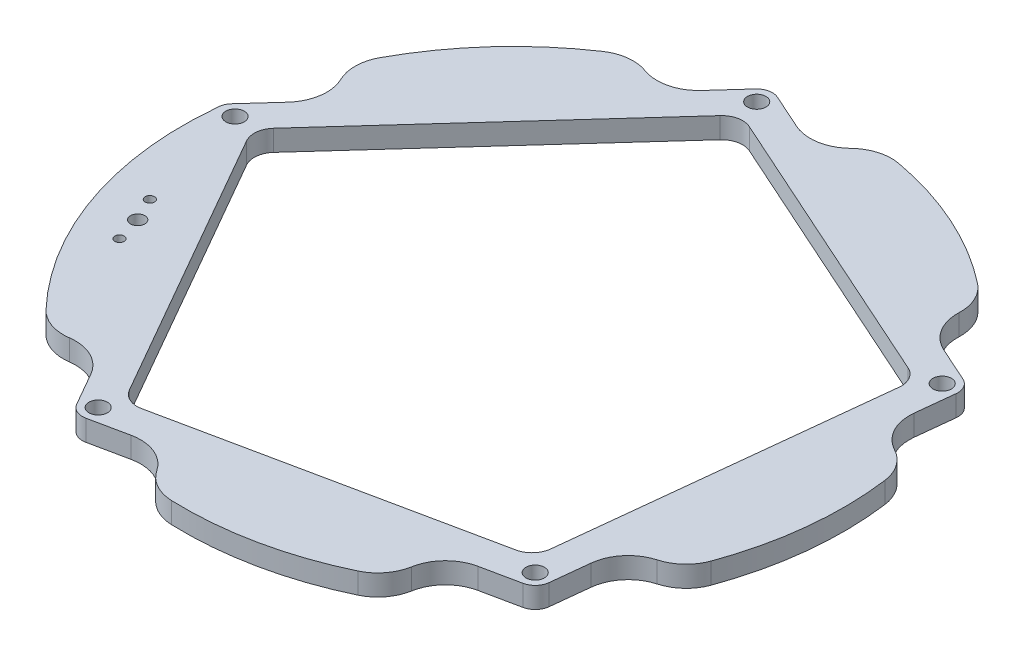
ISO-10303-21;
HEADER;
FILE_DESCRIPTION(('STEP AP214'),'2;1');
FILE_NAME('part.step','',(''),(''),'','','');
FILE_SCHEMA(('AUTOMOTIVE_DESIGN { 1 0 10303 214 1 1 1 1 }'));
ENDSEC;
DATA;
#1=APPLICATION_CONTEXT('core data for automotive mechanical design processes');
#2=APPLICATION_PROTOCOL_DEFINITION('international standard','automotive_design',2000,#1);
#3=PRODUCT_CONTEXT('',#1,'mechanical');
#4=PRODUCT('Part','Part','',(#3));
#5=PRODUCT_RELATED_PRODUCT_CATEGORY('part','',(#4));
#6=PRODUCT_DEFINITION_FORMATION('','',#4);
#7=PRODUCT_DEFINITION_CONTEXT('part definition',#1,'design');
#8=PRODUCT_DEFINITION('design','',#6,#7);
#9=PRODUCT_DEFINITION_SHAPE('','',#8);
#10=(LENGTH_UNIT() NAMED_UNIT(*) SI_UNIT(.MILLI.,.METRE.));
#11=(NAMED_UNIT(*) PLANE_ANGLE_UNIT() SI_UNIT($,.RADIAN.));
#12=(NAMED_UNIT(*) SI_UNIT($,.STERADIAN.) SOLID_ANGLE_UNIT());
#13=UNCERTAINTY_MEASURE_WITH_UNIT(LENGTH_MEASURE(1.E-05),#10,'distance_accuracy_value','');
#14=(GEOMETRIC_REPRESENTATION_CONTEXT(3) GLOBAL_UNCERTAINTY_ASSIGNED_CONTEXT((#13)) GLOBAL_UNIT_ASSIGNED_CONTEXT((#10,
#11,#12)) REPRESENTATION_CONTEXT('',''));
#15=CARTESIAN_POINT('',(0.,0.,0.));
#16=DIRECTION('',(0.,0.,1.));
#17=DIRECTION('',(1.,0.,0.));
#18=AXIS2_PLACEMENT_3D('',#15,#16,#17);
#19=CARTESIAN_POINT('',(-41.4815667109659,6.35,92.3219674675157));
#20=DIRECTION('',(-0.204580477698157,0.,-0.978849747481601));
#21=DIRECTION('',(-0.978849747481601,0.,0.204580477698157));
#22=AXIS2_PLACEMENT_3D('',#19,#20,#21);
#23=PLANE('',#22);
#24=DIRECTION('',(0.978849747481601,0.,-0.204580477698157));
#25=VECTOR('',#24,1.);
#26=CARTESIAN_POINT('',(-41.4815667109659,6.35,92.3219674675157));
#27=LINE('',#26,#25);
#28=CARTESIAN_POINT('',(-38.0945911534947,6.35,91.6140865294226));
#29=VERTEX_POINT('',#28);
#30=CARTESIAN_POINT('',(-26.7582047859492,6.35,89.2447715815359));
#31=VERTEX_POINT('',#30);
#32=EDGE_CURVE('E569',#29,#31,#27,.T.);
#33=ORIENTED_EDGE('',*,*,#32,.F.);
#34=DIRECTION('',(0.,-1.,0.));
#35=VECTOR('',#34,1.);
#36=CARTESIAN_POINT('',(-38.0945911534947,6.35,91.6140865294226));
#37=LINE('',#36,#35);
#38=CARTESIAN_POINT('',(-38.0945911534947,0.,91.6140865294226));
#39=VERTEX_POINT('',#38);
#40=EDGE_CURVE('E622',#29,#39,#37,.T.);
#41=ORIENTED_EDGE('',*,*,#40,.T.);
#42=DIRECTION('',(0.978849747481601,0.,-0.204580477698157));
#43=VECTOR('',#42,1.);
#44=CARTESIAN_POINT('',(-41.4815667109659,0.,92.3219674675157));
#45=LINE('',#44,#43);
#46=CARTESIAN_POINT('',(-26.7582047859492,0.,89.2447715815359));
#47=VERTEX_POINT('',#46);
#48=EDGE_CURVE('E585',#39,#47,#45,.T.);
#49=ORIENTED_EDGE('',*,*,#48,.T.);
#50=DIRECTION('',(0.,1.,0.));
#51=VECTOR('',#50,1.);
#52=CARTESIAN_POINT('',(-26.7582047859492,-91.81127883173,89.2447715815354));
#53=LINE('',#52,#51);
#54=EDGE_CURVE('E407',#47,#31,#53,.T.);
#55=ORIENTED_EDGE('',*,*,#54,.T.);
#56=EDGE_LOOP('',(#33,#41,#49,#55));
#57=FACE_BOUND('',#56,.T.);
#58=ADVANCED_FACE('F36',(#57),#23,.F.);
#59=CARTESIAN_POINT('',(74.9848996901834,6.35,67.9803712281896));
#60=DIRECTION('',(-0.994160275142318,0.,-0.107913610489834));
#61=DIRECTION('',(-0.107913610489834,0.,0.994160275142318));
#62=AXIS2_PLACEMENT_3D('',#59,#60,#61);
#63=PLANE('',#62);
#64=DIRECTION('',(0.107913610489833,0.,-0.994160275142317));
#65=VECTOR('',#64,1.);
#66=CARTESIAN_POINT('',(74.9848996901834,6.35,67.9803712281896));
#67=LINE('',#66,#65);
#68=CARTESIAN_POINT('',(75.35829791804,6.35,64.5404188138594));
#69=VERTEX_POINT('',#68);
#70=CARTESIAN_POINT('',(76.6080815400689,6.35,53.0267161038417));
#71=VERTEX_POINT('',#70);
#72=EDGE_CURVE('E573',#69,#71,#67,.T.);
#73=ORIENTED_EDGE('',*,*,#72,.F.);
#74=DIRECTION('',(0.,-1.,0.));
#75=VECTOR('',#74,1.);
#76=CARTESIAN_POINT('',(75.35829791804,6.35,64.5404188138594));
#77=LINE('',#76,#75);
#78=CARTESIAN_POINT('',(75.35829791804,0.,64.5404188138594));
#79=VERTEX_POINT('',#78);
#80=EDGE_CURVE('E584',#69,#79,#77,.T.);
#81=ORIENTED_EDGE('',*,*,#80,.T.);
#82=DIRECTION('',(0.107913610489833,0.,-0.994160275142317));
#83=VECTOR('',#82,1.);
#84=CARTESIAN_POINT('',(74.9848996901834,0.,67.9803712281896));
#85=LINE('',#84,#83);
#86=CARTESIAN_POINT('',(76.6080815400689,0.,53.0267161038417));
#87=VERTEX_POINT('',#86);
#88=EDGE_CURVE('E588',#79,#87,#85,.T.);
#89=ORIENTED_EDGE('',*,*,#88,.T.);
#90=DIRECTION('',(0.,1.,0.));
#91=VECTOR('',#90,1.);
#92=CARTESIAN_POINT('',(76.6080815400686,-91.5090366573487,53.0267161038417));
#93=LINE('',#92,#91);
#94=EDGE_CURVE('E447',#87,#71,#93,.T.);
#95=ORIENTED_EDGE('',*,*,#94,.T.);
#96=EDGE_LOOP('',(#73,#81,#89,#95));
#97=FACE_BOUND('',#96,.T.);
#98=ADVANCED_FACE('F724',(#97),#63,.F.);
#99=CARTESIAN_POINT('',(87.8247833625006,6.35,-50.3077874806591));
#100=DIRECTION('',(-0.409844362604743,0.,0.912155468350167));
#101=DIRECTION('',(0.912155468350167,0.,0.409844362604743));
#102=AXIS2_PLACEMENT_3D('',#99,#100,#101);
#103=PLANE('',#102);
#104=DIRECTION('',(-0.912155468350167,0.,-0.409844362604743));
#105=VECTOR('',#104,1.);
#106=CARTESIAN_POINT('',(87.8247833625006,6.35,-50.3077874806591));
#107=LINE('',#106,#105);
#108=CARTESIAN_POINT('',(84.6685806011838,6.35,-51.7259140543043));
#109=VERTEX_POINT('',#108);
#110=CARTESIAN_POINT('',(74.1046029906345,6.35,-56.4724587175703));
#111=VERTEX_POINT('',#110);
#112=EDGE_CURVE('E576',#109,#111,#107,.T.);
#113=ORIENTED_EDGE('',*,*,#112,.F.);
#114=DIRECTION('',(0.,-1.,0.));
#115=VECTOR('',#114,1.);
#116=CARTESIAN_POINT('',(84.6685806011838,6.35,-51.7259140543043));
#117=LINE('',#116,#115);
#118=CARTESIAN_POINT('',(84.6685806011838,0.,-51.7259140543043));
#119=VERTEX_POINT('',#118);
#120=EDGE_CURVE('E634',#109,#119,#117,.T.);
#121=ORIENTED_EDGE('',*,*,#120,.T.);
#122=DIRECTION('',(-0.912155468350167,0.,-0.409844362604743));
#123=VECTOR('',#122,1.);
#124=CARTESIAN_POINT('',(87.8247833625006,0.,-50.3077874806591));
#125=LINE('',#124,#123);
#126=CARTESIAN_POINT('',(74.1046029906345,0.,-56.4724587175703));
#127=VERTEX_POINT('',#126);
#128=EDGE_CURVE('E591',#119,#127,#125,.T.);
#129=ORIENTED_EDGE('',*,*,#128,.T.);
#130=DIRECTION('',(0.,1.,0.));
#131=VECTOR('',#130,1.);
#132=CARTESIAN_POINT('',(74.1046029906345,-91.5139284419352,-56.4724587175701));
#133=LINE('',#132,#131);
#134=EDGE_CURVE('E487',#127,#111,#133,.T.);
#135=ORIENTED_EDGE('',*,*,#134,.T.);
#136=EDGE_LOOP('',(#113,#121,#129,#135));
#137=FACE_BOUND('',#136,.T.);
#138=ADVANCED_FACE('F731',(#137),#103,.F.);
#139=CARTESIAN_POINT('',(-20.7061985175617,6.35,-99.0722937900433));
#140=DIRECTION('',(0.74086252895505,0.,0.671656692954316));
#141=DIRECTION('',(0.671656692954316,0.,-0.74086252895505));
#142=AXIS2_PLACEMENT_3D('',#139,#140,#141);
#143=PLANE('',#142);
#144=DIRECTION('',(-0.671656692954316,0.,0.74086252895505));
#145=VECTOR('',#144,1.);
#146=CARTESIAN_POINT('',(-20.7061985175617,6.35,-99.0722937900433));
#147=LINE('',#146,#145);
#148=CARTESIAN_POINT('',(-23.0302373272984,6.35,-96.5087917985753));
#149=VERTEX_POINT('',#148);
#150=CARTESIAN_POINT('',(-30.8089181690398,6.35,-87.928615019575));
#151=VERTEX_POINT('',#150);
#152=EDGE_CURVE('E579',#149,#151,#147,.T.);
#153=ORIENTED_EDGE('',*,*,#152,.F.);
#154=DIRECTION('',(0.,-1.,0.));
#155=VECTOR('',#154,1.);
#156=CARTESIAN_POINT('',(-23.0302373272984,6.35,-96.5087917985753));
#157=LINE('',#156,#155);
#158=CARTESIAN_POINT('',(-23.0302373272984,0.,-96.5087917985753));
#159=VERTEX_POINT('',#158);
#160=EDGE_CURVE('E629',#149,#159,#157,.T.);
#161=ORIENTED_EDGE('',*,*,#160,.T.);
#162=DIRECTION('',(-0.671656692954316,0.,0.74086252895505));
#163=VECTOR('',#162,1.);
#164=CARTESIAN_POINT('',(-20.7061985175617,0.,-99.0722937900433));
#165=LINE('',#164,#163);
#166=CARTESIAN_POINT('',(-30.8089181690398,0.,-87.928615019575));
#167=VERTEX_POINT('',#166);
#168=EDGE_CURVE('E594',#159,#167,#165,.T.);
#169=ORIENTED_EDGE('',*,*,#168,.T.);
#170=DIRECTION('',(0.,1.,0.));
#171=VECTOR('',#170,1.);
#172=CARTESIAN_POINT('',(-30.8089181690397,-88.9,-87.928615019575));
#173=LINE('',#172,#171);
#174=EDGE_CURVE('E527',#167,#151,#173,.T.);
#175=ORIENTED_EDGE('',*,*,#174,.T.);
#176=EDGE_LOOP('',(#153,#161,#169,#175));
#177=FACE_BOUND('',#176,.T.);
#178=ADVANCED_FACE('F830',(#177),#143,.F.);
#179=CARTESIAN_POINT('',(0.,6.35,0.));
#180=DIRECTION('',(0.,1.,0.));
#181=DIRECTION('',(0.,0.,1.));
#182=AXIS2_PLACEMENT_3D('',#179,#180,#181);
#183=PLANE('',#182);
#184=CARTESIAN_POINT('',(-85.9229262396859,6.35,24.4135612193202));
#185=DIRECTION('',(0.,1.,0.));
#186=DIRECTION('',(0.,0.,1.));
#187=AXIS2_PLACEMENT_3D('',#184,#185,#186);
#188=CIRCLE('',#187,1.4224);
#189=CARTESIAN_POINT('',(-85.9229262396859,6.35,25.8359612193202));
#190=VERTEX_POINT('',#189);
#191=EDGE_CURVE('E910',#190,#190,#188,.T.);
#192=ORIENTED_EDGE('',*,*,#191,.F.);
#193=EDGE_LOOP('',(#192));
#194=FACE_BOUND('',#193,.T.);
#195=CARTESIAN_POINT('',(-80.1890390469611,6.35,39.3508480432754));
#196=DIRECTION('',(0.,1.,0.));
#197=DIRECTION('',(0.,0.,1.));
#198=AXIS2_PLACEMENT_3D('',#195,#196,#197);
#199=CIRCLE('',#198,1.4224);
#200=CARTESIAN_POINT('',(-80.1890390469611,6.35,40.7732480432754));
#201=VERTEX_POINT('',#200);
#202=EDGE_CURVE('E904',#201,#201,#199,.T.);
#203=ORIENTED_EDGE('',*,*,#202,.F.);
#204=EDGE_LOOP('',(#203));
#205=FACE_BOUND('',#204,.T.);
#206=CARTESIAN_POINT('',(-82.4024763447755,6.35,31.6313470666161));
#207=DIRECTION('',(0.,1.,0.));
#208=DIRECTION('',(0.,0.,1.));
#209=AXIS2_PLACEMENT_3D('',#206,#207,#208);
#210=CIRCLE('',#209,2.18287599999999);
#211=CARTESIAN_POINT('',(-82.4024763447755,6.35,33.814223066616));
#212=VERTEX_POINT('',#211);
#213=EDGE_CURVE('E898',#212,#212,#210,.T.);
#214=ORIENTED_EDGE('',*,*,#213,.F.);
#215=EDGE_LOOP('',(#214));
#216=FACE_BOUND('',#215,.T.);
#217=CARTESIAN_POINT('',(70.6236096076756,6.35,64.0264802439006));
#218=DIRECTION('',(0.,1.,0.));
#219=DIRECTION('',(0.,0.,1.));
#220=AXIS2_PLACEMENT_3D('',#217,#218,#219);
#221=CIRCLE('',#220,2.80669999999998);
#222=CARTESIAN_POINT('',(70.6236096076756,6.35,66.8331802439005));
#223=VERTEX_POINT('',#222);
#224=EDGE_CURVE('E892',#223,#223,#221,.T.);
#225=ORIENTED_EDGE('',*,*,#224,.F.);
#226=EDGE_LOOP('',(#225));
#227=FACE_BOUND('',#226,.T.);
#228=CARTESIAN_POINT('',(-39.0689056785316,6.35,86.9523146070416));
#229=DIRECTION('',(0.,1.,0.));
#230=DIRECTION('',(0.,0.,1.));
#231=AXIS2_PLACEMENT_3D('',#228,#229,#230);
#232=CIRCLE('',#231,2.80669999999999);
#233=CARTESIAN_POINT('',(-39.0689056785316,6.35,89.7590146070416));
#234=VERTEX_POINT('',#233);
#235=EDGE_CURVE('E886',#234,#234,#232,.T.);
#236=ORIENTED_EDGE('',*,*,#235,.F.);
#237=EDGE_LOOP('',(#236));
#238=FACE_BOUND('',#237,.T.);
#239=CARTESIAN_POINT('',(-94.7695212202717,6.35,-10.2869944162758));
#240=DIRECTION('',(0.,1.,0.));
#241=DIRECTION('',(0.,0.,1.));
#242=AXIS2_PLACEMENT_3D('',#239,#240,#241);
#243=CIRCLE('',#242,2.8067);
#244=CARTESIAN_POINT('',(-94.7695212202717,6.35,-7.48029441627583));
#245=VERTEX_POINT('',#244);
#246=EDGE_CURVE('E880',#245,#245,#243,.T.);
#247=ORIENTED_EDGE('',*,*,#246,.F.);
#248=EDGE_LOOP('',(#247));
#249=FACE_BOUND('',#248,.T.);
#250=CARTESIAN_POINT('',(-19.5018795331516,6.35,-93.3100267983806));
#251=DIRECTION('',(0.,1.,0.));
#252=DIRECTION('',(0.,0.,1.));
#253=AXIS2_PLACEMENT_3D('',#250,#251,#252);
#254=CIRCLE('',#253,2.80669999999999);
#255=CARTESIAN_POINT('',(-19.5018795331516,6.35,-90.5033267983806));
#256=VERTEX_POINT('',#255);
#257=EDGE_CURVE('E874',#256,#256,#254,.T.);
#258=ORIENTED_EDGE('',*,*,#257,.F.);
#259=EDGE_LOOP('',(#258));
#260=FACE_BOUND('',#259,.T.);
#261=CARTESIAN_POINT('',(82.7166968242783,6.35,-47.3817736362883));
#262=DIRECTION('',(0.,1.,0.));
#263=DIRECTION('',(0.,0.,1.));
#264=AXIS2_PLACEMENT_3D('',#261,#262,#263);
#265=CIRCLE('',#264,2.8067);
#266=CARTESIAN_POINT('',(82.7166968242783,6.35,-44.5750736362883));
#267=VERTEX_POINT('',#266);
#268=EDGE_CURVE('E868',#267,#267,#265,.T.);
#269=ORIENTED_EDGE('',*,*,#268,.F.);
#270=EDGE_LOOP('',(#269));
#271=FACE_BOUND('',#270,.T.);
#272=CARTESIAN_POINT('',(60.2615377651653,6.35,71.0575671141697));
#273=VERTEX_POINT('',#272);
#274=CARTESIAN_POINT('',(71.5979241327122,6.35,68.6882521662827));
#275=VERTEX_POINT('',#274);
#276=EDGE_CURVE('E572',#273,#275,#27,.T.);
#277=ORIENTED_EDGE('',*,*,#276,.T.);
#278=CARTESIAN_POINT('',(70.6236096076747,6.35,64.0264802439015));
#279=DIRECTION('',(0.,1.,0.));
#280=DIRECTION('',(0.,0.,1.));
#281=AXIS2_PLACEMENT_3D('',#278,#279,#280);
#282=CIRCLE('',#281,4.7625);
#283=EDGE_CURVE('E620',#275,#69,#282,.T.);
#284=ORIENTED_EDGE('',*,*,#283,.T.);
#285=ORIENTED_EDGE('',*,*,#72,.T.);
#286=CARTESIAN_POINT('',(89.233917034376,6.35,54.3972189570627));
#287=DIRECTION('',(0.,-1.,0.));
#288=DIRECTION('',(0.587785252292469,0.,0.809016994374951));
#289=AXIS2_PLACEMENT_3D('',#286,#287,#288);
#290=CIRCLE('',#289,12.7);
#291=CARTESIAN_POINT('',(85.7940577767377,6.35,42.1719431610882));
#292=VERTEX_POINT('',#291);
#293=EDGE_CURVE('E442',#71,#292,#290,.T.);
#294=ORIENTED_EDGE('',*,*,#293,.T.);
#295=CARTESIAN_POINT('',(82.3541985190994,6.35,29.9466673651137));
#296=DIRECTION('',(0.,1.,0.));
#297=DIRECTION('',(-0.587785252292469,0.,-0.809016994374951));
#298=AXIS2_PLACEMENT_3D('',#295,#296,#297);
#299=CIRCLE('',#298,12.7);
#300=CARTESIAN_POINT('',(94.289589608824,6.35,34.2867640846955));
#301=VERTEX_POINT('',#300);
#302=EDGE_CURVE('E419',#292,#301,#299,.T.);
#303=ORIENTED_EDGE('',*,*,#302,.T.);
#304=CARTESIAN_POINT('',(0.,6.35,0.));
#305=DIRECTION('',(0.,1.,0.));
#306=DIRECTION('',(-0.587785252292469,0.,-0.809016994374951));
#307=AXIS2_PLACEMENT_3D('',#304,#305,#306);
#308=CIRCLE('',#307,100.33);
#309=CARTESIAN_POINT('',(99.4503225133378,6.35,-13.2567813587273));
#310=VERTEX_POINT('',#309);
#311=EDGE_CURVE('E433',#301,#310,#308,.T.);
#312=ORIENTED_EDGE('',*,*,#311,.T.);
#313=CARTESIAN_POINT('',(86.8616740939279,6.35,-11.578707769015));
#314=DIRECTION('',(0.,1.,0.));
#315=DIRECTION('',(0.587785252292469,0.,0.809016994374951));
#316=AXIS2_PLACEMENT_3D('',#313,#314,#315);
#317=CIRCLE('',#316,12.7);
#318=CARTESIAN_POINT('',(92.8445555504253,6.35,-22.7811686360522));
#319=VERTEX_POINT('',#318);
#320=EDGE_CURVE('E436',#310,#319,#317,.T.);
#321=ORIENTED_EDGE('',*,*,#320,.T.);
#322=CARTESIAN_POINT('',(98.8274370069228,6.35,-33.9836295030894));
#323=DIRECTION('',(0.,-1.,0.));
#324=DIRECTION('',(-0.587785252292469,0.,-0.809016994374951));
#325=AXIS2_PLACEMENT_3D('',#322,#323,#324);
#326=CIRCLE('',#325,12.7);
#327=CARTESIAN_POINT('',(86.2016015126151,6.35,-35.3541323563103));
#328=VERTEX_POINT('',#327);
#329=EDGE_CURVE('E439',#319,#328,#326,.T.);
#330=ORIENTED_EDGE('',*,*,#329,.T.);
#331=CARTESIAN_POINT('',(87.451385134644,6.35,-46.8678350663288));
#332=VERTEX_POINT('',#331);
#333=EDGE_CURVE('E571',#328,#332,#67,.T.);
#334=ORIENTED_EDGE('',*,*,#333,.T.);
#335=CARTESIAN_POINT('',(82.7166968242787,6.35,-47.3817736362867));
#336=DIRECTION('',(0.,1.,0.));
#337=DIRECTION('',(0.,0.,1.));
#338=AXIS2_PLACEMENT_3D('',#335,#336,#337);
#339=CIRCLE('',#338,4.7625);
#340=EDGE_CURVE('E613',#332,#109,#339,.T.);
#341=ORIENTED_EDGE('',*,*,#340,.T.);
#342=ORIENTED_EDGE('',*,*,#112,.T.);
#343=CARTESIAN_POINT('',(79.3096263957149,6.35,-68.0568331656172));
#344=DIRECTION('',(0.,-1.,0.));
#345=DIRECTION('',(0.951056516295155,0.,-0.309016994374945));
#346=AXIS2_PLACEMENT_3D('',#343,#344,#345);
#347=CIRCLE('',#346,12.7);
#348=CARTESIAN_POINT('',(66.6197232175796,6.35,-68.5631505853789));
#349=VERTEX_POINT('',#348);
#350=EDGE_CURVE('E482',#111,#349,#347,.T.);
#351=ORIENTED_EDGE('',*,*,#350,.T.);
#352=CARTESIAN_POINT('',(53.9298200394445,6.35,-69.0694680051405));
#353=DIRECTION('',(0.,1.,0.));
#354=DIRECTION('',(-0.951056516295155,0.,0.309016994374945));
#355=AXIS2_PLACEMENT_3D('',#352,#353,#354);
#356=CIRCLE('',#355,12.7);
#357=CARTESIAN_POINT('',(61.7457359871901,6.35,-79.0795358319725));
#358=VERTEX_POINT('',#357);
#359=EDGE_CURVE('E459',#349,#358,#356,.T.);
#360=ORIENTED_EDGE('',*,*,#359,.T.);
#361=CARTESIAN_POINT('',(0.,6.35,0.));
#362=DIRECTION('',(0.,1.,0.));
#363=DIRECTION('',(-0.951056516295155,0.,0.309016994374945));
#364=AXIS2_PLACEMENT_3D('',#361,#362,#363);
#365=CIRCLE('',#364,100.33);
#366=CARTESIAN_POINT('',(18.1238914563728,6.35,-98.6794480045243));
#367=VERTEX_POINT('',#366);
#368=EDGE_CURVE('E473',#358,#367,#365,.T.);
#369=ORIENTED_EDGE('',*,*,#368,.T.);
#370=CARTESIAN_POINT('',(15.8297279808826,6.35,-86.188378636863));
#371=DIRECTION('',(0.,1.,0.));
#372=DIRECTION('',(0.951056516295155,0.,-0.309016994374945));
#373=AXIS2_PLACEMENT_3D('',#370,#371,#372);
#374=CIRCLE('',#373,12.7);
#375=CARTESIAN_POINT('',(7.02436662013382,6.35,-95.3401878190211));
#376=VERTEX_POINT('',#375);
#377=EDGE_CURVE('E476',#367,#376,#374,.T.);
#378=ORIENTED_EDGE('',*,*,#377,.T.);
#379=CARTESIAN_POINT('',(-1.78099474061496,6.35,-104.491997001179));
#380=DIRECTION('',(0.,-1.,0.));
#381=DIRECTION('',(-0.951056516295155,0.,0.309016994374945));
#382=AXIS2_PLACEMENT_3D('',#379,#380,#381);
#383=CIRCLE('',#382,12.7);
#384=CARTESIAN_POINT('',(-6.9860181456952,6.35,-92.9076225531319));
#385=VERTEX_POINT('',#384);
#386=EDGE_CURVE('E479',#376,#385,#383,.T.);
#387=ORIENTED_EDGE('',*,*,#386,.T.);
#388=CARTESIAN_POINT('',(-17.5499957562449,6.35,-97.6541672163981));
#389=VERTEX_POINT('',#388);
#390=EDGE_CURVE('E575',#385,#389,#107,.T.);
#391=ORIENTED_EDGE('',*,*,#390,.T.);
#392=CARTESIAN_POINT('',(-19.50187953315,6.35,-93.3100267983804));
#393=DIRECTION('',(0.,1.,0.));
#394=DIRECTION('',(0.,0.,1.));
#395=AXIS2_PLACEMENT_3D('',#392,#393,#394);
#396=CIRCLE('',#395,4.7625);
#397=EDGE_CURVE('E615',#389,#149,#396,.T.);
#398=ORIENTED_EDGE('',*,*,#397,.T.);
#399=ORIENTED_EDGE('',*,*,#152,.T.);
#400=CARTESIAN_POINT('',(-40.2178722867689,6.35,-96.4586550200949));
#401=DIRECTION('',(0.,-1.,0.));
#402=DIRECTION('',(0.,0.,-1.));
#403=AXIS2_PLACEMENT_3D('',#400,#401,#402);
#404=CIRCLE('',#403,12.7);
#405=CARTESIAN_POINT('',(-44.6208045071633,6.35,-84.5463005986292));
#406=VERTEX_POINT('',#405);
#407=EDGE_CURVE('E522',#151,#406,#404,.T.);
#408=ORIENTED_EDGE('',*,*,#407,.T.);
#409=CARTESIAN_POINT('',(-49.0237367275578,6.35,-72.6339461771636));
#410=DIRECTION('',(0.,1.,0.));
#411=DIRECTION('',(0.,0.,1.));
#412=AXIS2_PLACEMENT_3D('',#409,#410,#411);
#413=CIRCLE('',#412,12.7);
#414=CARTESIAN_POINT('',(-56.1286261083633,6.35,-83.1606050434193));
#415=VERTEX_POINT('',#414);
#416=EDGE_CURVE('E499',#406,#415,#413,.T.);
#417=ORIENTED_EDGE('',*,*,#416,.T.);
#418=CARTESIAN_POINT('',(0.,6.35,0.));
#419=DIRECTION('',(0.,1.,0.));
#420=DIRECTION('',(0.,0.,1.));
#421=AXIS2_PLACEMENT_3D('',#418,#419,#420);
#422=CIRCLE('',#421,100.33);
#423=CARTESIAN_POINT('',(-88.2491415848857,6.35,-47.7304714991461));
#424=VERTEX_POINT('',#423);
#425=EDGE_CURVE('E513',#415,#424,#422,.T.);
#426=ORIENTED_EDGE('',*,*,#425,.T.);
#427=CARTESIAN_POINT('',(-77.0783641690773,6.35,-41.6886396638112));
#428=DIRECTION('',(0.,1.,0.));
#429=DIRECTION('',(0.,0.,-1.));
#430=AXIS2_PLACEMENT_3D('',#427,#428,#429);
#431=CIRCLE('',#430,12.7);
#432=CARTESIAN_POINT('',(-88.5032582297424,6.35,-36.142307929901));
#433=VERTEX_POINT('',#432);
#434=EDGE_CURVE('E516',#424,#433,#431,.T.);
#435=ORIENTED_EDGE('',*,*,#434,.T.);
#436=CARTESIAN_POINT('',(-99.9281522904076,6.35,-30.5959761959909));
#437=DIRECTION('',(0.,-1.,0.));
#438=DIRECTION('',(0.,0.,1.));
#439=AXIS2_PLACEMENT_3D('',#436,#437,#438);
#440=CIRCLE('',#439,12.7);
#441=CARTESIAN_POINT('',(-90.5191981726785,6.35,-22.065936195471));
#442=VERTEX_POINT('',#441);
#443=EDGE_CURVE('E519',#433,#442,#440,.T.);
#444=ORIENTED_EDGE('',*,*,#443,.T.);
#445=CARTESIAN_POINT('',(-98.6440721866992,6.34999999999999,-13.103895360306));
#446=VERTEX_POINT('',#445);
#447=EDGE_CURVE('E578',#442,#446,#147,.T.);
#448=ORIENTED_EDGE('',*,*,#447,.T.);
#449=CARTESIAN_POINT('',(-95.1157143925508,6.34999999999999,-9.90513036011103));
#450=DIRECTION('',(0.,1.,0.));
#451=DIRECTION('',(0.,0.,1.));
#452=AXIS2_PLACEMENT_3D('',#449,#450,#451);
#453=CIRCLE('',#452,4.7625);
#454=CARTESIAN_POINT('',(-99.8689182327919,6.35,-9.60770893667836));
#455=VERTEX_POINT('',#454);
#456=EDGE_CURVE('E363',#446,#455,#453,.T.);
#457=ORIENTED_EDGE('',*,*,#456,.T.);
#458=CARTESIAN_POINT('',(0.,6.35,0.));
#459=DIRECTION('',(0.,1.,0.));
#460=DIRECTION('',(0.95105651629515,0.,0.309016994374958));
#461=AXIS2_PLACEMENT_3D('',#458,#459,#460);
#462=CIRCLE('',#461,100.33);
#463=CARTESIAN_POINT('',(-72.6648604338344,6.35,69.1803943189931));
#464=VERTEX_POINT('',#463);
#465=EDGE_CURVE('E342',#455,#464,#462,.T.);
#466=ORIENTED_EDGE('',*,*,#465,.T.);
#467=CARTESIAN_POINT('',(-63.4667768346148,6.35,60.42338237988));
#468=DIRECTION('',(0.,1.,0.));
#469=DIRECTION('',(-0.95105651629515,0.,-0.309016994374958));
#470=AXIS2_PLACEMENT_3D('',#467,#468,#469);
#471=CIRCLE('',#470,12.7);
#472=CARTESIAN_POINT('',(-61.7223883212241,6.35,73.0030130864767));
#473=VERTEX_POINT('',#472);
#474=EDGE_CURVE('E352',#464,#473,#471,.T.);
#475=ORIENTED_EDGE('',*,*,#474,.T.);
#476=CARTESIAN_POINT('',(-59.9779998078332,6.35,85.5826437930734));
#477=DIRECTION('',(0.,-1.,0.));
#478=DIRECTION('',(0.95105651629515,0.,0.309016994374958));
#479=AXIS2_PLACEMENT_3D('',#476,#477,#478);
#480=CIRCLE('',#479,12.7);
#481=CARTESIAN_POINT('',(-48.9579229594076,6.35,79.2701239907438));
#482=VERTEX_POINT('',#481);
#483=EDGE_CURVE('E349',#473,#482,#480,.T.);
#484=ORIENTED_EDGE('',*,*,#483,.T.);
#485=DIRECTION('',(0.497048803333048,0.,0.867722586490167));
#486=VECTOR('',#485,1.);
#487=CARTESIAN_POINT('',(-100.621917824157,6.35,-10.9222574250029));
#488=LINE('',#487,#486);
#489=CARTESIAN_POINT('',(-43.2014344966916,6.35,89.3195095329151));
#490=VERTEX_POINT('',#489);
#491=EDGE_CURVE('E581',#482,#490,#488,.T.);
#492=ORIENTED_EDGE('',*,*,#491,.T.);
#493=CARTESIAN_POINT('',(-39.0689056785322,6.35,86.9523146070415));
#494=DIRECTION('',(0.,1.,0.));
#495=DIRECTION('',(0.,0.,1.));
#496=AXIS2_PLACEMENT_3D('',#493,#494,#495);
#497=CIRCLE('',#496,4.7625);
#498=EDGE_CURVE('E618',#490,#29,#497,.T.);
#499=ORIENTED_EDGE('',*,*,#498,.T.);
#500=ORIENTED_EDGE('',*,*,#32,.T.);
#501=CARTESIAN_POINT('',(-24.1600327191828,6.35,101.676163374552));
#502=DIRECTION('',(0.,-1.,0.));
#503=DIRECTION('',(-0.58778525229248,0.,0.809016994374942));
#504=AXIS2_PLACEMENT_3D('',#501,#502,#503);
#505=CIRCLE('',#504,12.7);
#506=CARTESIAN_POINT('',(-13.596079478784,6.35,94.6268448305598));
#507=VERTEX_POINT('',#506);
#508=EDGE_CURVE('E402',#31,#507,#505,.T.);
#509=ORIENTED_EDGE('',*,*,#508,.T.);
#510=CARTESIAN_POINT('',(-3.03212623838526,6.35,87.5775262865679));
#511=DIRECTION('',(0.,1.,0.));
#512=DIRECTION('',(0.58778525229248,0.,-0.809016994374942));
#513=AXIS2_PLACEMENT_3D('',#510,#511,#512);
#514=CIRCLE('',#513,12.7);
#515=CARTESIAN_POINT('',(-3.47156482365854,6.35,100.269921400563));
#516=VERTEX_POINT('',#515);
#517=EDGE_CURVE('E379',#507,#516,#514,.T.);
#518=ORIENTED_EDGE('',*,*,#517,.T.);
#519=CARTESIAN_POINT('',(0.,6.35,0.));
#520=DIRECTION('',(0.,1.,0.));
#521=DIRECTION('',(0.58778525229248,0.,-0.809016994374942));
#522=AXIS2_PLACEMENT_3D('',#519,#520,#521);
#523=CIRCLE('',#522,100.33);
#524=CARTESIAN_POINT('',(43.3397880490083,6.35,90.4863065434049));
#525=VERTEX_POINT('',#524);
#526=EDGE_CURVE('E393',#516,#525,#523,.T.);
#527=ORIENTED_EDGE('',*,*,#526,.T.);
#528=CARTESIAN_POINT('',(37.8537389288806,6.35,79.0323436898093));
#529=DIRECTION('',(0.,1.,0.));
#530=DIRECTION('',(-0.58778525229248,0.,0.809016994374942));
#531=AXIS2_PLACEMENT_3D('',#528,#529,#530);
#532=CIRCLE('',#531,12.7);
#533=CARTESIAN_POINT('',(50.3567243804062,6.35,81.2606512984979));
#534=VERTEX_POINT('',#533);
#535=EDGE_CURVE('E396',#525,#534,#532,.T.);
#536=ORIENTED_EDGE('',*,*,#535,.T.);
#537=CARTESIAN_POINT('',(62.8597098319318,6.35,83.4889589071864));
#538=DIRECTION('',(0.,-1.,0.));
#539=DIRECTION('',(0.58778525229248,0.,-0.809016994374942));
#540=AXIS2_PLACEMENT_3D('',#537,#538,#539);
#541=CIRCLE('',#540,12.7);
#542=EDGE_CURVE('E399',#534,#273,#541,.T.);
#543=ORIENTED_EDGE('',*,*,#542,.T.);
#544=EDGE_LOOP('',(#277,#284,#285,#294,#303,#312,#321,#330,#334,#341,#342,#351,#360,#369,#378,
#387,#391,#398,#399,#408,#417,#426,#435,#444,#448,#457,#466,#475,#484,#492,#499,#500,#509,#518,
#527,#536,#543));
#545=FACE_BOUND('',#544,.T.);
#546=DIRECTION('',(0.978849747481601,0.,-0.204580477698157));
#547=VECTOR('',#546,1.);
#548=CARTESIAN_POINT('',(-36.6562446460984,6.35,81.5826617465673));
#549=LINE('',#548,#547);
#550=CARTESIAN_POINT('',(-32.1402772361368,6.35,80.6388204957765));
#551=VERTEX_POINT('',#550);
#552=CARTESIAN_POINT('',(61.7463521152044,6.35,61.0164305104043));
#553=VERTEX_POINT('',#552);
#554=EDGE_CURVE('E543',#551,#553,#549,.T.);
#555=ORIENTED_EDGE('',*,*,#554,.F.);
#556=CARTESIAN_POINT('',(-33.4393632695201,6.35,74.4231245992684));
#557=DIRECTION('',(0.,1.,0.));
#558=DIRECTION('',(0.,0.,1.));
#559=AXIS2_PLACEMENT_3D('',#556,#557,#558);
#560=CIRCLE('',#559,6.35);
#561=CARTESIAN_POINT('',(-38.9494016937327,6.35,77.5793845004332));
#562=VERTEX_POINT('',#561);
#563=EDGE_CURVE('E673',#551,#562,#560,.F.);
#564=ORIENTED_EDGE('',*,*,#563,.T.);
#565=DIRECTION('',(0.497048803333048,0.,0.867722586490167));
#566=VECTOR('',#565,1.);
#567=CARTESIAN_POINT('',(-88.9171246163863,6.35,-9.65173140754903));
#568=LINE('',#567,#566);
#569=CARTESIAN_POINT('',(-86.623967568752,6.35,-5.64845416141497));
#570=VERTEX_POINT('',#569);
#571=EDGE_CURVE('E540',#570,#562,#568,.T.);
#572=ORIENTED_EDGE('',*,*,#571,.F.);
#573=CARTESIAN_POINT('',(-81.1139291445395,6.35,-8.80471406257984));
#574=DIRECTION('',(0.,1.,0.));
#575=DIRECTION('',(0.,0.,1.));
#576=AXIS2_PLACEMENT_3D('',#573,#574,#575);
#577=CIRCLE('',#576,6.35);
#578=CARTESIAN_POINT('',(-85.818406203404,6.35,-13.0697340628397));
#579=VERTEX_POINT('',#578);
#580=EDGE_CURVE('E51',#570,#579,#577,.F.);
#581=ORIENTED_EDGE('',*,*,#580,.T.);
#582=DIRECTION('',(-0.671656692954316,0.,0.74086252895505));
#583=VECTOR('',#582,1.);
#584=CARTESIAN_POINT('',(-18.2975605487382,6.35,-87.5477598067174));
#585=LINE('',#584,#583);
#586=CARTESIAN_POINT('',(-21.3962789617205,6.35,-84.1297571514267));
#587=VERTEX_POINT('',#586);
#588=EDGE_CURVE('E553',#587,#579,#585,.T.);
#589=ORIENTED_EDGE('',*,*,#588,.F.);
#590=CARTESIAN_POINT('',(-16.6918019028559,6.35,-79.8647371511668));
#591=DIRECTION('',(0.,1.,0.));
#592=DIRECTION('',(0.,0.,1.));
#593=AXIS2_PLACEMENT_3D('',#590,#591,#592);
#594=CIRCLE('',#593,6.35);
#595=CARTESIAN_POINT('',(-14.0892902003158,6.35,-85.6569243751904));
#596=VERTEX_POINT('',#595);
#597=EDGE_CURVE('E11',#587,#596,#594,.F.);
#598=ORIENTED_EDGE('',*,*,#597,.T.);
#599=DIRECTION('',(-0.912155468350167,0.,-0.409844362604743));
#600=VECTOR('',#599,1.);
#601=CARTESIAN_POINT('',(77.6086102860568,6.35,-44.4557597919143));
#602=LINE('',#601,#600);
#603=CARTESIAN_POINT('',(73.4003399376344,6.35,-46.3465952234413));
#604=VERTEX_POINT('',#603);
#605=EDGE_CURVE('E550',#604,#596,#602,.T.);
#606=ORIENTED_EDGE('',*,*,#605,.F.);
#607=CARTESIAN_POINT('',(70.7978282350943,6.35,-40.5544079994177));
#608=DIRECTION('',(0.,1.,0.));
#609=DIRECTION('',(0.,0.,1.));
#610=AXIS2_PLACEMENT_3D('',#607,#608,#609);
#611=CIRCLE('',#610,6.35);
#612=CARTESIAN_POINT('',(77.110745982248,6.35,-39.8691565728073));
#613=VERTEX_POINT('',#612);
#614=EDGE_CURVE('E665',#604,#613,#611,.F.);
#615=ORIENTED_EDGE('',*,*,#614,.T.);
#616=DIRECTION('',(0.107913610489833,0.,-0.994160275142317));
#617=VECTOR('',#616,1.);
#618=CARTESIAN_POINT('',(66.262319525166,6.35,60.0725892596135));
#619=LINE('',#618,#617);
#620=CARTESIAN_POINT('',(66.7601838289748,6.35,55.4859860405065));
#621=VERTEX_POINT('',#620);
#622=EDGE_CURVE('E547',#621,#613,#619,.T.);
#623=ORIENTED_EDGE('',*,*,#622,.F.);
#624=CARTESIAN_POINT('',(60.4472660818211,6.35,54.8007346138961));
#625=DIRECTION('',(0.,1.,0.));
#626=DIRECTION('',(0.,0.,1.));
#627=AXIS2_PLACEMENT_3D('',#624,#625,#626);
#628=CIRCLE('',#627,6.35);
#629=EDGE_CURVE('E669',#621,#553,#628,.F.);
#630=ORIENTED_EDGE('',*,*,#629,.T.);
#631=EDGE_LOOP('',(#555,#564,#572,#581,#589,#598,#606,#615,#623,#630));
#632=FACE_BOUND('',#631,.T.);
#633=ADVANCED_FACE('F360',(#194,#205,#216,#227,#238,#249,#260,#271,#545,#632),#183,.T.);
#634=CARTESIAN_POINT('',(0.,0.,0.));
#635=DIRECTION('',(0.,1.,0.));
#636=DIRECTION('',(0.,0.,1.));
#637=AXIS2_PLACEMENT_3D('',#634,#635,#636);
#638=PLANE('',#637);
#639=CARTESIAN_POINT('',(-85.9229262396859,0.,24.4135612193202));
#640=DIRECTION('',(0.,1.,0.));
#641=DIRECTION('',(0.,0.,1.));
#642=AXIS2_PLACEMENT_3D('',#639,#640,#641);
#643=CIRCLE('',#642,1.4224);
#644=CARTESIAN_POINT('',(-85.9229262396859,0.,25.8359612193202));
#645=VERTEX_POINT('',#644);
#646=EDGE_CURVE('E907',#645,#645,#643,.T.);
#647=ORIENTED_EDGE('',*,*,#646,.T.);
#648=EDGE_LOOP('',(#647));
#649=FACE_BOUND('',#648,.T.);
#650=CARTESIAN_POINT('',(-80.1890390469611,0.,39.3508480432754));
#651=DIRECTION('',(0.,1.,0.));
#652=DIRECTION('',(0.,0.,1.));
#653=AXIS2_PLACEMENT_3D('',#650,#651,#652);
#654=CIRCLE('',#653,1.4224);
#655=CARTESIAN_POINT('',(-80.1890390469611,0.,40.7732480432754));
#656=VERTEX_POINT('',#655);
#657=EDGE_CURVE('E901',#656,#656,#654,.T.);
#658=ORIENTED_EDGE('',*,*,#657,.T.);
#659=EDGE_LOOP('',(#658));
#660=FACE_BOUND('',#659,.T.);
#661=CARTESIAN_POINT('',(-82.4024763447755,0.,31.6313470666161));
#662=DIRECTION('',(0.,1.,0.));
#663=DIRECTION('',(0.,0.,1.));
#664=AXIS2_PLACEMENT_3D('',#661,#662,#663);
#665=CIRCLE('',#664,2.18287599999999);
#666=CARTESIAN_POINT('',(-82.4024763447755,0.,33.814223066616));
#667=VERTEX_POINT('',#666);
#668=EDGE_CURVE('E895',#667,#667,#665,.T.);
#669=ORIENTED_EDGE('',*,*,#668,.T.);
#670=EDGE_LOOP('',(#669));
#671=FACE_BOUND('',#670,.T.);
#672=CARTESIAN_POINT('',(70.6236096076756,0.,64.0264802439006));
#673=DIRECTION('',(0.,1.,0.));
#674=DIRECTION('',(0.,0.,1.));
#675=AXIS2_PLACEMENT_3D('',#672,#673,#674);
#676=CIRCLE('',#675,2.8067);
#677=CARTESIAN_POINT('',(70.6236096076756,0.,66.8331802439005));
#678=VERTEX_POINT('',#677);
#679=EDGE_CURVE('E889',#678,#678,#676,.T.);
#680=ORIENTED_EDGE('',*,*,#679,.T.);
#681=EDGE_LOOP('',(#680));
#682=FACE_BOUND('',#681,.T.);
#683=CARTESIAN_POINT('',(-39.0689056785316,0.,86.9523146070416));
#684=DIRECTION('',(0.,1.,0.));
#685=DIRECTION('',(0.,0.,1.));
#686=AXIS2_PLACEMENT_3D('',#683,#684,#685);
#687=CIRCLE('',#686,2.8067);
#688=CARTESIAN_POINT('',(-39.0689056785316,0.,89.7590146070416));
#689=VERTEX_POINT('',#688);
#690=EDGE_CURVE('E883',#689,#689,#687,.T.);
#691=ORIENTED_EDGE('',*,*,#690,.T.);
#692=EDGE_LOOP('',(#691));
#693=FACE_BOUND('',#692,.T.);
#694=CARTESIAN_POINT('',(-94.7695212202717,0.,-10.2869944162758));
#695=DIRECTION('',(0.,1.,0.));
#696=DIRECTION('',(0.,0.,1.));
#697=AXIS2_PLACEMENT_3D('',#694,#695,#696);
#698=CIRCLE('',#697,2.8067);
#699=CARTESIAN_POINT('',(-94.7695212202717,0.,-7.48029441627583));
#700=VERTEX_POINT('',#699);
#701=EDGE_CURVE('E877',#700,#700,#698,.T.);
#702=ORIENTED_EDGE('',*,*,#701,.T.);
#703=EDGE_LOOP('',(#702));
#704=FACE_BOUND('',#703,.T.);
#705=CARTESIAN_POINT('',(-19.5018795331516,0.,-93.3100267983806));
#706=DIRECTION('',(0.,1.,0.));
#707=DIRECTION('',(0.,0.,1.));
#708=AXIS2_PLACEMENT_3D('',#705,#706,#707);
#709=CIRCLE('',#708,2.8067);
#710=CARTESIAN_POINT('',(-19.5018795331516,0.,-90.5033267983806));
#711=VERTEX_POINT('',#710);
#712=EDGE_CURVE('E871',#711,#711,#709,.T.);
#713=ORIENTED_EDGE('',*,*,#712,.T.);
#714=EDGE_LOOP('',(#713));
#715=FACE_BOUND('',#714,.T.);
#716=CARTESIAN_POINT('',(82.7166968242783,0.,-47.3817736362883));
#717=DIRECTION('',(0.,1.,0.));
#718=DIRECTION('',(0.,0.,1.));
#719=AXIS2_PLACEMENT_3D('',#716,#717,#718);
#720=CIRCLE('',#719,2.8067);
#721=CARTESIAN_POINT('',(82.7166968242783,0.,-44.5750736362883));
#722=VERTEX_POINT('',#721);
#723=EDGE_CURVE('E366',#722,#722,#720,.T.);
#724=ORIENTED_EDGE('',*,*,#723,.T.);
#725=EDGE_LOOP('',(#724));
#726=FACE_BOUND('',#725,.T.);
#727=ORIENTED_EDGE('',*,*,#88,.F.);
#728=CARTESIAN_POINT('',(70.6236096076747,0.,64.0264802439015));
#729=DIRECTION('',(0.,1.,0.));
#730=DIRECTION('',(0.,0.,1.));
#731=AXIS2_PLACEMENT_3D('',#728,#729,#730);
#732=CIRCLE('',#731,4.7625);
#733=CARTESIAN_POINT('',(71.5979241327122,0.,68.6882521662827));
#734=VERTEX_POINT('',#733);
#735=EDGE_CURVE('E609',#79,#734,#732,.F.);
#736=ORIENTED_EDGE('',*,*,#735,.T.);
#737=CARTESIAN_POINT('',(60.2615377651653,0.,71.05756711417));
#738=VERTEX_POINT('',#737);
#739=EDGE_CURVE('E555',#738,#734,#45,.T.);
#740=ORIENTED_EDGE('',*,*,#739,.F.);
#741=CARTESIAN_POINT('',(62.8597098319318,0.,83.4889589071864));
#742=DIRECTION('',(0.,1.,0.));
#743=DIRECTION('',(0.,0.,1.));
#744=AXIS2_PLACEMENT_3D('',#741,#742,#743);
#745=CIRCLE('',#744,12.7);
#746=CARTESIAN_POINT('',(50.3567243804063,0.,81.2606512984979));
#747=VERTEX_POINT('',#746);
#748=EDGE_CURVE('E382',#738,#747,#745,.T.);
#749=ORIENTED_EDGE('',*,*,#748,.T.);
#750=CARTESIAN_POINT('',(37.8537389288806,0.,79.0323436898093));
#751=DIRECTION('',(0.,1.,0.));
#752=DIRECTION('',(0.,0.,1.));
#753=AXIS2_PLACEMENT_3D('',#750,#751,#752);
#754=CIRCLE('',#753,12.7);
#755=CARTESIAN_POINT('',(43.3397880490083,0.,90.4863065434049));
#756=VERTEX_POINT('',#755);
#757=EDGE_CURVE('E380',#747,#756,#754,.F.);
#758=ORIENTED_EDGE('',*,*,#757,.T.);
#759=CARTESIAN_POINT('',(0.,0.,0.));
#760=DIRECTION('',(0.,1.,0.));
#761=DIRECTION('',(0.,0.,1.));
#762=AXIS2_PLACEMENT_3D('',#759,#760,#761);
#763=CIRCLE('',#762,100.33);
#764=CARTESIAN_POINT('',(-3.47156482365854,0.,100.269921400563));
#765=VERTEX_POINT('',#764);
#766=EDGE_CURVE('E390',#756,#765,#763,.F.);
#767=ORIENTED_EDGE('',*,*,#766,.T.);
#768=CARTESIAN_POINT('',(-3.03212623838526,0.,87.5775262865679));
#769=DIRECTION('',(0.,1.,0.));
#770=DIRECTION('',(0.,0.,1.));
#771=AXIS2_PLACEMENT_3D('',#768,#769,#770);
#772=CIRCLE('',#771,12.7);
#773=CARTESIAN_POINT('',(-13.596079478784,0.,94.6268448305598));
#774=VERTEX_POINT('',#773);
#775=EDGE_CURVE('E388',#765,#774,#772,.F.);
#776=ORIENTED_EDGE('',*,*,#775,.T.);
#777=CARTESIAN_POINT('',(-24.1600327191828,0.,101.676163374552));
#778=DIRECTION('',(0.,1.,0.));
#779=DIRECTION('',(0.,0.,1.));
#780=AXIS2_PLACEMENT_3D('',#777,#778,#779);
#781=CIRCLE('',#780,12.7);
#782=EDGE_CURVE('E385',#774,#47,#781,.T.);
#783=ORIENTED_EDGE('',*,*,#782,.T.);
#784=ORIENTED_EDGE('',*,*,#48,.F.);
#785=CARTESIAN_POINT('',(-39.0689056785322,0.,86.9523146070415));
#786=DIRECTION('',(0.,1.,0.));
#787=DIRECTION('',(0.,0.,1.));
#788=AXIS2_PLACEMENT_3D('',#785,#786,#787);
#789=CIRCLE('',#788,4.7625);
#790=CARTESIAN_POINT('',(-43.2014344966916,0.,89.3195095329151));
#791=VERTEX_POINT('',#790);
#792=EDGE_CURVE('E607',#39,#791,#789,.F.);
#793=ORIENTED_EDGE('',*,*,#792,.T.);
#794=DIRECTION('',(0.497048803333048,0.,0.867722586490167));
#795=VECTOR('',#794,1.);
#796=CARTESIAN_POINT('',(-100.621917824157,0.,-10.9222574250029));
#797=LINE('',#796,#795);
#798=CARTESIAN_POINT('',(-48.9579229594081,0.,79.2701239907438));
#799=VERTEX_POINT('',#798);
#800=EDGE_CURVE('E596',#799,#791,#797,.T.);
#801=ORIENTED_EDGE('',*,*,#800,.F.);
#802=CARTESIAN_POINT('',(-59.9779998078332,0.,85.5826437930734));
#803=DIRECTION('',(0.,1.,0.));
#804=DIRECTION('',(0.,0.,1.));
#805=AXIS2_PLACEMENT_3D('',#802,#803,#804);
#806=CIRCLE('',#805,12.7);
#807=CARTESIAN_POINT('',(-61.722388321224,0.,73.0030130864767));
#808=VERTEX_POINT('',#807);
#809=EDGE_CURVE('E369',#799,#808,#806,.T.);
#810=ORIENTED_EDGE('',*,*,#809,.T.);
#811=CARTESIAN_POINT('',(-63.4667768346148,0.,60.42338237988));
#812=DIRECTION('',(0.,1.,0.));
#813=DIRECTION('',(0.,0.,1.));
#814=AXIS2_PLACEMENT_3D('',#811,#812,#813);
#815=CIRCLE('',#814,12.7);
#816=CARTESIAN_POINT('',(-72.6648604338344,0.,69.1803943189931));
#817=VERTEX_POINT('',#816);
#818=EDGE_CURVE('E376',#808,#817,#815,.F.);
#819=ORIENTED_EDGE('',*,*,#818,.T.);
#820=CARTESIAN_POINT('',(0.,0.,0.));
#821=DIRECTION('',(0.,1.,0.));
#822=DIRECTION('',(0.,0.,1.));
#823=AXIS2_PLACEMENT_3D('',#820,#821,#822);
#824=CIRCLE('',#823,100.33);
#825=CARTESIAN_POINT('',(-99.8689182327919,0.,-9.60770893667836));
#826=VERTEX_POINT('',#825);
#827=EDGE_CURVE('E345',#817,#826,#824,.F.);
#828=ORIENTED_EDGE('',*,*,#827,.T.);
#829=CARTESIAN_POINT('',(-95.1157143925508,0.,-9.90513036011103));
#830=DIRECTION('',(0.,1.,0.));
#831=DIRECTION('',(0.,0.,1.));
#832=AXIS2_PLACEMENT_3D('',#829,#830,#831);
#833=CIRCLE('',#832,4.7625);
#834=CARTESIAN_POINT('',(-98.6440721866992,0.,-13.1038953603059));
#835=VERTEX_POINT('',#834);
#836=EDGE_CURVE('E605',#826,#835,#833,.F.);
#837=ORIENTED_EDGE('',*,*,#836,.T.);
#838=CARTESIAN_POINT('',(-90.5191981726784,0.,-22.0659361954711));
#839=VERTEX_POINT('',#838);
#840=EDGE_CURVE('E593',#839,#835,#165,.T.);
#841=ORIENTED_EDGE('',*,*,#840,.F.);
#842=CARTESIAN_POINT('',(-99.9281522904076,0.,-30.5959761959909));
#843=DIRECTION('',(0.,1.,0.));
#844=DIRECTION('',(0.,0.,1.));
#845=AXIS2_PLACEMENT_3D('',#842,#843,#844);
#846=CIRCLE('',#845,12.7);
#847=CARTESIAN_POINT('',(-88.5032582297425,0.,-36.142307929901));
#848=VERTEX_POINT('',#847);
#849=EDGE_CURVE('E502',#839,#848,#846,.T.);
#850=ORIENTED_EDGE('',*,*,#849,.T.);
#851=CARTESIAN_POINT('',(-77.0783641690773,0.,-41.6886396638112));
#852=DIRECTION('',(0.,1.,0.));
#853=DIRECTION('',(0.,0.,1.));
#854=AXIS2_PLACEMENT_3D('',#851,#852,#853);
#855=CIRCLE('',#854,12.7);
#856=CARTESIAN_POINT('',(-88.2491415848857,0.,-47.7304714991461));
#857=VERTEX_POINT('',#856);
#858=EDGE_CURVE('E500',#848,#857,#855,.F.);
#859=ORIENTED_EDGE('',*,*,#858,.T.);
#860=CARTESIAN_POINT('',(0.,0.,0.));
#861=DIRECTION('',(0.,1.,0.));
#862=DIRECTION('',(0.,0.,1.));
#863=AXIS2_PLACEMENT_3D('',#860,#861,#862);
#864=CIRCLE('',#863,100.33);
#865=CARTESIAN_POINT('',(-56.1286261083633,0.,-83.1606050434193));
#866=VERTEX_POINT('',#865);
#867=EDGE_CURVE('E510',#857,#866,#864,.F.);
#868=ORIENTED_EDGE('',*,*,#867,.T.);
#869=CARTESIAN_POINT('',(-49.0237367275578,0.,-72.6339461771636));
#870=DIRECTION('',(0.,1.,0.));
#871=DIRECTION('',(0.,0.,1.));
#872=AXIS2_PLACEMENT_3D('',#869,#870,#871);
#873=CIRCLE('',#872,12.7);
#874=CARTESIAN_POINT('',(-44.6208045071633,0.,-84.5463005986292));
#875=VERTEX_POINT('',#874);
#876=EDGE_CURVE('E508',#866,#875,#873,.F.);
#877=ORIENTED_EDGE('',*,*,#876,.T.);
#878=CARTESIAN_POINT('',(-40.2178722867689,0.,-96.4586550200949));
#879=DIRECTION('',(0.,1.,0.));
#880=DIRECTION('',(0.,0.,1.));
#881=AXIS2_PLACEMENT_3D('',#878,#879,#880);
#882=CIRCLE('',#881,12.7);
#883=EDGE_CURVE('E505',#875,#167,#882,.T.);
#884=ORIENTED_EDGE('',*,*,#883,.T.);
#885=ORIENTED_EDGE('',*,*,#168,.F.);
#886=CARTESIAN_POINT('',(-19.50187953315,0.,-93.3100267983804));
#887=DIRECTION('',(0.,1.,0.));
#888=DIRECTION('',(0.,0.,1.));
#889=AXIS2_PLACEMENT_3D('',#886,#887,#888);
#890=CIRCLE('',#889,4.7625);
#891=CARTESIAN_POINT('',(-17.5499957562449,0.,-97.6541672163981));
#892=VERTEX_POINT('',#891);
#893=EDGE_CURVE('E603',#159,#892,#890,.F.);
#894=ORIENTED_EDGE('',*,*,#893,.T.);
#895=CARTESIAN_POINT('',(-6.9860181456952,0.,-92.907622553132));
#896=VERTEX_POINT('',#895);
#897=EDGE_CURVE('E590',#896,#892,#125,.T.);
#898=ORIENTED_EDGE('',*,*,#897,.F.);
#899=CARTESIAN_POINT('',(-1.78099474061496,0.,-104.491997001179));
#900=DIRECTION('',(0.,1.,0.));
#901=DIRECTION('',(0.,0.,1.));
#902=AXIS2_PLACEMENT_3D('',#899,#900,#901);
#903=CIRCLE('',#902,12.7);
#904=CARTESIAN_POINT('',(7.02436662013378,0.,-95.3401878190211));
#905=VERTEX_POINT('',#904);
#906=EDGE_CURVE('E462',#896,#905,#903,.T.);
#907=ORIENTED_EDGE('',*,*,#906,.T.);
#908=CARTESIAN_POINT('',(15.8297279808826,0.,-86.188378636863));
#909=DIRECTION('',(0.,1.,0.));
#910=DIRECTION('',(0.,0.,1.));
#911=AXIS2_PLACEMENT_3D('',#908,#909,#910);
#912=CIRCLE('',#911,12.7);
#913=CARTESIAN_POINT('',(18.1238914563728,0.,-98.6794480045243));
#914=VERTEX_POINT('',#913);
#915=EDGE_CURVE('E460',#905,#914,#912,.F.);
#916=ORIENTED_EDGE('',*,*,#915,.T.);
#917=CARTESIAN_POINT('',(0.,0.,0.));
#918=DIRECTION('',(0.,1.,0.));
#919=DIRECTION('',(0.,0.,1.));
#920=AXIS2_PLACEMENT_3D('',#917,#918,#919);
#921=CIRCLE('',#920,100.33);
#922=CARTESIAN_POINT('',(61.7457359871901,0.,-79.0795358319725));
#923=VERTEX_POINT('',#922);
#924=EDGE_CURVE('E470',#914,#923,#921,.F.);
#925=ORIENTED_EDGE('',*,*,#924,.T.);
#926=CARTESIAN_POINT('',(53.9298200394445,0.,-69.0694680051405));
#927=DIRECTION('',(0.,1.,0.));
#928=DIRECTION('',(0.,0.,1.));
#929=AXIS2_PLACEMENT_3D('',#926,#927,#928);
#930=CIRCLE('',#929,12.7);
#931=CARTESIAN_POINT('',(66.6197232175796,0.,-68.5631505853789));
#932=VERTEX_POINT('',#931);
#933=EDGE_CURVE('E468',#923,#932,#930,.F.);
#934=ORIENTED_EDGE('',*,*,#933,.T.);
#935=CARTESIAN_POINT('',(79.3096263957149,0.,-68.0568331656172));
#936=DIRECTION('',(0.,1.,0.));
#937=DIRECTION('',(0.,0.,1.));
#938=AXIS2_PLACEMENT_3D('',#935,#936,#937);
#939=CIRCLE('',#938,12.7);
#940=EDGE_CURVE('E465',#932,#127,#939,.T.);
#941=ORIENTED_EDGE('',*,*,#940,.T.);
#942=ORIENTED_EDGE('',*,*,#128,.F.);
#943=CARTESIAN_POINT('',(82.7166968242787,0.,-47.3817736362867));
#944=DIRECTION('',(0.,1.,0.));
#945=DIRECTION('',(0.,0.,1.));
#946=AXIS2_PLACEMENT_3D('',#943,#944,#945);
#947=CIRCLE('',#946,4.7625);
#948=CARTESIAN_POINT('',(87.451385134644,0.,-46.8678350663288));
#949=VERTEX_POINT('',#948);
#950=EDGE_CURVE('E601',#119,#949,#947,.F.);
#951=ORIENTED_EDGE('',*,*,#950,.T.);
#952=CARTESIAN_POINT('',(86.2016015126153,0.,-35.3541323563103));
#953=VERTEX_POINT('',#952);
#954=EDGE_CURVE('E587',#953,#949,#85,.T.);
#955=ORIENTED_EDGE('',*,*,#954,.F.);
#956=CARTESIAN_POINT('',(98.8274370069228,0.,-33.9836295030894));
#957=DIRECTION('',(0.,1.,0.));
#958=DIRECTION('',(0.,0.,1.));
#959=AXIS2_PLACEMENT_3D('',#956,#957,#958);
#960=CIRCLE('',#959,12.7);
#961=CARTESIAN_POINT('',(92.8445555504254,0.,-22.7811686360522));
#962=VERTEX_POINT('',#961);
#963=EDGE_CURVE('E422',#953,#962,#960,.T.);
#964=ORIENTED_EDGE('',*,*,#963,.T.);
#965=CARTESIAN_POINT('',(86.8616740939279,0.,-11.578707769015));
#966=DIRECTION('',(0.,1.,0.));
#967=DIRECTION('',(0.,0.,1.));
#968=AXIS2_PLACEMENT_3D('',#965,#966,#967);
#969=CIRCLE('',#968,12.7);
#970=CARTESIAN_POINT('',(99.4503225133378,0.,-13.2567813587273));
#971=VERTEX_POINT('',#970);
#972=EDGE_CURVE('E420',#962,#971,#969,.F.);
#973=ORIENTED_EDGE('',*,*,#972,.T.);
#974=CARTESIAN_POINT('',(0.,0.,0.));
#975=DIRECTION('',(0.,1.,0.));
#976=DIRECTION('',(0.,0.,1.));
#977=AXIS2_PLACEMENT_3D('',#974,#975,#976);
#978=CIRCLE('',#977,100.33);
#979=CARTESIAN_POINT('',(94.289589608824,0.,34.2867640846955));
#980=VERTEX_POINT('',#979);
#981=EDGE_CURVE('E430',#971,#980,#978,.F.);
#982=ORIENTED_EDGE('',*,*,#981,.T.);
#983=CARTESIAN_POINT('',(82.3541985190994,0.,29.9466673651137));
#984=DIRECTION('',(0.,1.,0.));
#985=DIRECTION('',(0.,0.,1.));
#986=AXIS2_PLACEMENT_3D('',#983,#984,#985);
#987=CIRCLE('',#986,12.7);
#988=CARTESIAN_POINT('',(85.7940577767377,0.,42.1719431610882));
#989=VERTEX_POINT('',#988);
#990=EDGE_CURVE('E428',#980,#989,#987,.F.);
#991=ORIENTED_EDGE('',*,*,#990,.T.);
#992=CARTESIAN_POINT('',(89.233917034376,0.,54.3972189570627));
#993=DIRECTION('',(0.,1.,0.));
#994=DIRECTION('',(0.,0.,1.));
#995=AXIS2_PLACEMENT_3D('',#992,#993,#994);
#996=CIRCLE('',#995,12.7);
#997=EDGE_CURVE('E425',#989,#87,#996,.T.);
#998=ORIENTED_EDGE('',*,*,#997,.T.);
#999=EDGE_LOOP('',(#727,#736,#740,#749,#758,#767,#776,#783,#784,#793,#801,#810,#819,#828,#837,
#841,#850,#859,#868,#877,#884,#885,#894,#898,#907,#916,#925,#934,#941,#942,#951,#955,#964,#973,
#982,#991,#998));
#1000=FACE_BOUND('',#999,.T.);
#1001=DIRECTION('',(-0.671656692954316,0.,0.74086252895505));
#1002=VECTOR('',#1001,1.);
#1003=CARTESIAN_POINT('',(-18.2975605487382,0.,-87.5477598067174));
#1004=LINE('',#1003,#1002);
#1005=CARTESIAN_POINT('',(-21.3962789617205,0.,-84.1297571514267));
#1006=VERTEX_POINT('',#1005);
#1007=CARTESIAN_POINT('',(-85.818406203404,0.,-13.0697340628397));
#1008=VERTEX_POINT('',#1007);
#1009=EDGE_CURVE('E544',#1006,#1008,#1004,.T.);
#1010=ORIENTED_EDGE('',*,*,#1009,.T.);
#1011=CARTESIAN_POINT('',(-81.1139291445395,0.,-8.80471406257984));
#1012=DIRECTION('',(0.,1.,0.));
#1013=DIRECTION('',(0.,0.,1.));
#1014=AXIS2_PLACEMENT_3D('',#1011,#1012,#1013);
#1015=CIRCLE('',#1014,6.35);
#1016=CARTESIAN_POINT('',(-86.623967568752,0.,-5.64845416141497));
#1017=VERTEX_POINT('',#1016);
#1018=EDGE_CURVE('E675',#1008,#1017,#1015,.T.);
#1019=ORIENTED_EDGE('',*,*,#1018,.T.);
#1020=DIRECTION('',(0.497048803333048,0.,0.867722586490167));
#1021=VECTOR('',#1020,1.);
#1022=CARTESIAN_POINT('',(-88.9171246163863,0.,-9.65173140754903));
#1023=LINE('',#1022,#1021);
#1024=CARTESIAN_POINT('',(-38.9494016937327,0.,77.5793845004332));
#1025=VERTEX_POINT('',#1024);
#1026=EDGE_CURVE('E539',#1017,#1025,#1023,.T.);
#1027=ORIENTED_EDGE('',*,*,#1026,.T.);
#1028=CARTESIAN_POINT('',(-33.4393632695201,0.,74.4231245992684));
#1029=DIRECTION('',(0.,1.,0.));
#1030=DIRECTION('',(0.,0.,1.));
#1031=AXIS2_PLACEMENT_3D('',#1028,#1029,#1030);
#1032=CIRCLE('',#1031,6.35);
#1033=CARTESIAN_POINT('',(-32.1402772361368,0.,80.6388204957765));
#1034=VERTEX_POINT('',#1033);
#1035=EDGE_CURVE('E671',#1025,#1034,#1032,.T.);
#1036=ORIENTED_EDGE('',*,*,#1035,.T.);
#1037=DIRECTION('',(0.978849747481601,0.,-0.204580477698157));
#1038=VECTOR('',#1037,1.);
#1039=CARTESIAN_POINT('',(-36.6562446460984,0.,81.5826617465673));
#1040=LINE('',#1039,#1038);
#1041=CARTESIAN_POINT('',(61.7463521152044,0.,61.0164305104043));
#1042=VERTEX_POINT('',#1041);
#1043=EDGE_CURVE('E558',#1034,#1042,#1040,.T.);
#1044=ORIENTED_EDGE('',*,*,#1043,.T.);
#1045=CARTESIAN_POINT('',(60.4472660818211,0.,54.8007346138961));
#1046=DIRECTION('',(0.,1.,0.));
#1047=DIRECTION('',(0.,0.,1.));
#1048=AXIS2_PLACEMENT_3D('',#1045,#1046,#1047);
#1049=CIRCLE('',#1048,6.35);
#1050=CARTESIAN_POINT('',(66.7601838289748,0.,55.4859860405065));
#1051=VERTEX_POINT('',#1050);
#1052=EDGE_CURVE('E667',#1042,#1051,#1049,.T.);
#1053=ORIENTED_EDGE('',*,*,#1052,.T.);
#1054=DIRECTION('',(0.107913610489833,0.,-0.994160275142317));
#1055=VECTOR('',#1054,1.);
#1056=CARTESIAN_POINT('',(66.262319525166,0.,60.0725892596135));
#1057=LINE('',#1056,#1055);
#1058=CARTESIAN_POINT('',(77.110745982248,0.,-39.8691565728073));
#1059=VERTEX_POINT('',#1058);
#1060=EDGE_CURVE('E561',#1051,#1059,#1057,.T.);
#1061=ORIENTED_EDGE('',*,*,#1060,.T.);
#1062=CARTESIAN_POINT('',(70.7978282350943,0.,-40.5544079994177));
#1063=DIRECTION('',(0.,1.,0.));
#1064=DIRECTION('',(0.,0.,1.));
#1065=AXIS2_PLACEMENT_3D('',#1062,#1063,#1064);
#1066=CIRCLE('',#1065,6.35);
#1067=CARTESIAN_POINT('',(73.4003399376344,0.,-46.3465952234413));
#1068=VERTEX_POINT('',#1067);
#1069=EDGE_CURVE('E663',#1059,#1068,#1066,.T.);
#1070=ORIENTED_EDGE('',*,*,#1069,.T.);
#1071=DIRECTION('',(-0.912155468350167,0.,-0.409844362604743));
#1072=VECTOR('',#1071,1.);
#1073=CARTESIAN_POINT('',(77.6086102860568,0.,-44.4557597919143));
#1074=LINE('',#1073,#1072);
#1075=CARTESIAN_POINT('',(-14.0892902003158,0.,-85.6569243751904));
#1076=VERTEX_POINT('',#1075);
#1077=EDGE_CURVE('E564',#1068,#1076,#1074,.T.);
#1078=ORIENTED_EDGE('',*,*,#1077,.T.);
#1079=CARTESIAN_POINT('',(-16.6918019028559,0.,-79.8647371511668));
#1080=DIRECTION('',(0.,1.,0.));
#1081=DIRECTION('',(0.,0.,1.));
#1082=AXIS2_PLACEMENT_3D('',#1079,#1080,#1081);
#1083=CIRCLE('',#1082,6.35);
#1084=EDGE_CURVE('E44',#1076,#1006,#1083,.T.);
#1085=ORIENTED_EDGE('',*,*,#1084,.T.);
#1086=EDGE_LOOP('',(#1010,#1019,#1027,#1036,#1044,#1053,#1061,#1070,#1078,#1085));
#1087=FACE_BOUND('',#1086,.T.);
#1088=ADVANCED_FACE('F678',(#649,#660,#671,#682,#693,#704,#715,#726,#1000,#1087),#638,.F.);
#1089=ORIENTED_EDGE('',*,*,#739,.T.);
#1090=DIRECTION('',(0.,-1.,0.));
#1091=VECTOR('',#1090,1.);
#1092=CARTESIAN_POINT('',(71.5979241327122,6.35,68.6882521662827));
#1093=LINE('',#1092,#1091);
#1094=EDGE_CURVE('E611',#734,#275,#1093,.F.);
#1095=ORIENTED_EDGE('',*,*,#1094,.T.);
#1096=ORIENTED_EDGE('',*,*,#276,.F.);
#1097=DIRECTION('',(0.,1.,0.));
#1098=VECTOR('',#1097,1.);
#1099=CARTESIAN_POINT('',(60.2615377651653,-91.81127883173,71.05756711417));
#1100=LINE('',#1099,#1098);
#1101=EDGE_CURVE('E410',#738,#273,#1100,.T.);
#1102=ORIENTED_EDGE('',*,*,#1101,.F.);
#1103=EDGE_LOOP('',(#1089,#1095,#1096,#1102));
#1104=FACE_BOUND('',#1103,.T.);
#1105=ADVANCED_FACE('F727',(#1104),#23,.F.);
#1106=ORIENTED_EDGE('',*,*,#954,.T.);
#1107=DIRECTION('',(0.,-1.,0.));
#1108=VECTOR('',#1107,1.);
#1109=CARTESIAN_POINT('',(87.451385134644,6.35,-46.8678350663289));
#1110=LINE('',#1109,#1108);
#1111=EDGE_CURVE('E637',#949,#332,#1110,.F.);
#1112=ORIENTED_EDGE('',*,*,#1111,.T.);
#1113=ORIENTED_EDGE('',*,*,#333,.F.);
#1114=DIRECTION('',(0.,1.,0.));
#1115=VECTOR('',#1114,1.);
#1116=CARTESIAN_POINT('',(86.2016015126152,-91.5090366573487,-35.3541323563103));
#1117=LINE('',#1116,#1115);
#1118=EDGE_CURVE('E450',#953,#328,#1117,.T.);
#1119=ORIENTED_EDGE('',*,*,#1118,.F.);
#1120=EDGE_LOOP('',(#1106,#1112,#1113,#1119));
#1121=FACE_BOUND('',#1120,.T.);
#1122=ADVANCED_FACE('F734',(#1121),#63,.F.);
#1123=ORIENTED_EDGE('',*,*,#897,.T.);
#1124=DIRECTION('',(0.,-1.,0.));
#1125=VECTOR('',#1124,1.);
#1126=CARTESIAN_POINT('',(-17.5499957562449,6.35,-97.6541672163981));
#1127=LINE('',#1126,#1125);
#1128=EDGE_CURVE('E632',#892,#389,#1127,.F.);
#1129=ORIENTED_EDGE('',*,*,#1128,.T.);
#1130=ORIENTED_EDGE('',*,*,#390,.F.);
#1131=DIRECTION('',(0.,1.,0.));
#1132=VECTOR('',#1131,1.);
#1133=CARTESIAN_POINT('',(-6.98601814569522,-91.5139284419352,-92.907622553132));
#1134=LINE('',#1133,#1132);
#1135=EDGE_CURVE('E490',#896,#385,#1134,.T.);
#1136=ORIENTED_EDGE('',*,*,#1135,.F.);
#1137=EDGE_LOOP('',(#1123,#1129,#1130,#1136));
#1138=FACE_BOUND('',#1137,.T.);
#1139=ADVANCED_FACE('F743',(#1138),#103,.F.);
#1140=ORIENTED_EDGE('',*,*,#840,.T.);
#1141=DIRECTION('',(0.,1.,0.));
#1142=VECTOR('',#1141,1.);
#1143=CARTESIAN_POINT('',(-98.6440721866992,6.35,-13.1038953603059));
#1144=LINE('',#1143,#1142);
#1145=EDGE_CURVE('E627',#835,#446,#1144,.T.);
#1146=ORIENTED_EDGE('',*,*,#1145,.T.);
#1147=ORIENTED_EDGE('',*,*,#447,.F.);
#1148=DIRECTION('',(0.,1.,0.));
#1149=VECTOR('',#1148,1.);
#1150=CARTESIAN_POINT('',(-90.5191981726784,-88.9,-22.065936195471));
#1151=LINE('',#1150,#1149);
#1152=EDGE_CURVE('E530',#839,#442,#1151,.T.);
#1153=ORIENTED_EDGE('',*,*,#1152,.F.);
#1154=EDGE_LOOP('',(#1140,#1146,#1147,#1153));
#1155=FACE_BOUND('',#1154,.T.);
#1156=ADVANCED_FACE('F860',(#1155),#143,.F.);
#1157=CARTESIAN_POINT('',(-100.621917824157,6.35,-10.9222574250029));
#1158=DIRECTION('',(0.867722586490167,0.,-0.497048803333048));
#1159=DIRECTION('',(-0.497048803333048,0.,-0.867722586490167));
#1160=AXIS2_PLACEMENT_3D('',#1157,#1158,#1159);
#1161=PLANE('',#1160);
#1162=ORIENTED_EDGE('',*,*,#800,.T.);
#1163=DIRECTION('',(0.,-1.,0.));
#1164=VECTOR('',#1163,1.);
#1165=CARTESIAN_POINT('',(-43.2014344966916,6.35,89.3195095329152));
#1166=LINE('',#1165,#1164);
#1167=EDGE_CURVE('E625',#791,#490,#1166,.F.);
#1168=ORIENTED_EDGE('',*,*,#1167,.T.);
#1169=ORIENTED_EDGE('',*,*,#491,.F.);
#1170=DIRECTION('',(0.,1.,0.));
#1171=VECTOR('',#1170,1.);
#1172=CARTESIAN_POINT('',(-48.957922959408,-90.8394507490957,79.2701239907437));
#1173=LINE('',#1172,#1171);
#1174=EDGE_CURVE('E373',#799,#482,#1173,.T.);
#1175=ORIENTED_EDGE('',*,*,#1174,.F.);
#1176=EDGE_LOOP('',(#1162,#1168,#1169,#1175));
#1177=FACE_BOUND('',#1176,.T.);
#1178=ADVANCED_FACE('F1016',(#1177),#1161,.F.);
#1179=CARTESIAN_POINT('',(-88.9171246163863,6.35,-9.65173140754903));
#1180=DIRECTION('',(0.867722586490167,0.,-0.497048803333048));
#1181=DIRECTION('',(-0.497048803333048,0.,-0.867722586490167));
#1182=AXIS2_PLACEMENT_3D('',#1179,#1180,#1181);
#1183=PLANE('',#1182);
#1184=ORIENTED_EDGE('',*,*,#571,.T.);
#1185=DIRECTION('',(0.,-1.,0.));
#1186=VECTOR('',#1185,1.);
#1187=CARTESIAN_POINT('',(-38.9494016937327,0.,77.5793845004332));
#1188=LINE('',#1187,#1186);
#1189=EDGE_CURVE('E656',#562,#1025,#1188,.T.);
#1190=ORIENTED_EDGE('',*,*,#1189,.T.);
#1191=ORIENTED_EDGE('',*,*,#1026,.F.);
#1192=DIRECTION('',(0.,-1.,0.));
#1193=VECTOR('',#1192,1.);
#1194=CARTESIAN_POINT('',(-86.623967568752,6.35,-5.64845416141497));
#1195=LINE('',#1194,#1193);
#1196=EDGE_CURVE('E654',#1017,#570,#1195,.F.);
#1197=ORIENTED_EDGE('',*,*,#1196,.T.);
#1198=EDGE_LOOP('',(#1184,#1190,#1191,#1197));
#1199=FACE_BOUND('',#1198,.T.);
#1200=ADVANCED_FACE('F712',(#1199),#1183,.T.);
#1201=CARTESIAN_POINT('',(-36.6562446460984,6.35,81.5826617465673));
#1202=DIRECTION('',(-0.204580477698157,0.,-0.978849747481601));
#1203=DIRECTION('',(-0.978849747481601,0.,0.204580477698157));
#1204=AXIS2_PLACEMENT_3D('',#1201,#1202,#1203);
#1205=PLANE('',#1204);
#1206=ORIENTED_EDGE('',*,*,#554,.T.);
#1207=DIRECTION('',(0.,-1.,0.));
#1208=VECTOR('',#1207,1.);
#1209=CARTESIAN_POINT('',(61.7463521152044,0.,61.0164305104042));
#1210=LINE('',#1209,#1208);
#1211=EDGE_CURVE('E651',#553,#1042,#1210,.T.);
#1212=ORIENTED_EDGE('',*,*,#1211,.T.);
#1213=ORIENTED_EDGE('',*,*,#1043,.F.);
#1214=DIRECTION('',(0.,-1.,0.));
#1215=VECTOR('',#1214,1.);
#1216=CARTESIAN_POINT('',(-32.1402772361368,6.35,80.6388204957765));
#1217=LINE('',#1216,#1215);
#1218=EDGE_CURVE('E649',#1034,#551,#1217,.F.);
#1219=ORIENTED_EDGE('',*,*,#1218,.T.);
#1220=EDGE_LOOP('',(#1206,#1212,#1213,#1219));
#1221=FACE_BOUND('',#1220,.T.);
#1222=ADVANCED_FACE('F705',(#1221),#1205,.T.);
#1223=CARTESIAN_POINT('',(66.262319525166,6.35,60.0725892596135));
#1224=DIRECTION('',(-0.994160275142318,0.,-0.107913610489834));
#1225=DIRECTION('',(-0.107913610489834,0.,0.994160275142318));
#1226=AXIS2_PLACEMENT_3D('',#1223,#1224,#1225);
#1227=PLANE('',#1226);
#1228=ORIENTED_EDGE('',*,*,#622,.T.);
#1229=DIRECTION('',(0.,-1.,0.));
#1230=VECTOR('',#1229,1.);
#1231=CARTESIAN_POINT('',(77.110745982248,0.,-39.8691565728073));
#1232=LINE('',#1231,#1230);
#1233=EDGE_CURVE('E641',#613,#1059,#1232,.T.);
#1234=ORIENTED_EDGE('',*,*,#1233,.T.);
#1235=ORIENTED_EDGE('',*,*,#1060,.F.);
#1236=DIRECTION('',(0.,-1.,0.));
#1237=VECTOR('',#1236,1.);
#1238=CARTESIAN_POINT('',(66.7601838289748,6.35,55.4859860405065));
#1239=LINE('',#1238,#1237);
#1240=EDGE_CURVE('E639',#1051,#621,#1239,.F.);
#1241=ORIENTED_EDGE('',*,*,#1240,.T.);
#1242=EDGE_LOOP('',(#1228,#1234,#1235,#1241));
#1243=FACE_BOUND('',#1242,.T.);
#1244=ADVANCED_FACE('F697',(#1243),#1227,.T.);
#1245=CARTESIAN_POINT('',(77.6086102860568,6.35,-44.4557597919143));
#1246=DIRECTION('',(-0.409844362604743,0.,0.912155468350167));
#1247=DIRECTION('',(0.912155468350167,0.,0.409844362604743));
#1248=AXIS2_PLACEMENT_3D('',#1245,#1246,#1247);
#1249=PLANE('',#1248);
#1250=ORIENTED_EDGE('',*,*,#1077,.F.);
#1251=DIRECTION('',(0.,-1.,0.));
#1252=VECTOR('',#1251,1.);
#1253=CARTESIAN_POINT('',(73.4003399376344,6.35,-46.3465952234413));
#1254=LINE('',#1253,#1252);
#1255=EDGE_CURVE('E647',#1068,#604,#1254,.F.);
#1256=ORIENTED_EDGE('',*,*,#1255,.T.);
#1257=ORIENTED_EDGE('',*,*,#605,.T.);
#1258=DIRECTION('',(0.,-1.,0.));
#1259=VECTOR('',#1258,1.);
#1260=CARTESIAN_POINT('',(-14.0892902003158,0.,-85.6569243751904));
#1261=LINE('',#1260,#1259);
#1262=EDGE_CURVE('E644',#596,#1076,#1261,.T.);
#1263=ORIENTED_EDGE('',*,*,#1262,.T.);
#1264=EDGE_LOOP('',(#1250,#1256,#1257,#1263));
#1265=FACE_BOUND('',#1264,.T.);
#1266=ADVANCED_FACE('F689',(#1265),#1249,.T.);
#1267=CARTESIAN_POINT('',(-18.2975605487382,6.35,-87.5477598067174));
#1268=DIRECTION('',(0.74086252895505,0.,0.671656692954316));
#1269=DIRECTION('',(0.671656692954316,0.,-0.74086252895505));
#1270=AXIS2_PLACEMENT_3D('',#1267,#1268,#1269);
#1271=PLANE('',#1270);
#1272=ORIENTED_EDGE('',*,*,#588,.T.);
#1273=DIRECTION('',(0.,-1.,0.));
#1274=VECTOR('',#1273,1.);
#1275=CARTESIAN_POINT('',(-85.818406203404,0.,-13.0697340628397));
#1276=LINE('',#1275,#1274);
#1277=EDGE_CURVE('E660',#579,#1008,#1276,.T.);
#1278=ORIENTED_EDGE('',*,*,#1277,.T.);
#1279=ORIENTED_EDGE('',*,*,#1009,.F.);
#1280=DIRECTION('',(0.,-1.,0.));
#1281=VECTOR('',#1280,1.);
#1282=CARTESIAN_POINT('',(-21.3962789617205,6.35,-84.1297571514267));
#1283=LINE('',#1282,#1281);
#1284=EDGE_CURVE('E58',#1006,#587,#1283,.F.);
#1285=ORIENTED_EDGE('',*,*,#1284,.T.);
#1286=EDGE_LOOP('',(#1272,#1278,#1279,#1285));
#1287=FACE_BOUND('',#1286,.T.);
#1288=ADVANCED_FACE('F682',(#1287),#1271,.T.);
#1289=CARTESIAN_POINT('',(-49.0237367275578,-88.9,-72.6339461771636));
#1290=DIRECTION('',(0.,1.,0.));
#1291=DIRECTION('',(0.,0.,1.));
#1292=AXIS2_PLACEMENT_3D('',#1289,#1290,#1291);
#1293=CYLINDRICAL_SURFACE('',#1292,12.7);
#1294=ORIENTED_EDGE('',*,*,#876,.F.);
#1295=DIRECTION('',(0.,1.,0.));
#1296=VECTOR('',#1295,1.);
#1297=CARTESIAN_POINT('',(-56.1286261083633,-88.9,-83.1606050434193));
#1298=LINE('',#1297,#1296);
#1299=EDGE_CURVE('E525',#866,#415,#1298,.T.);
#1300=ORIENTED_EDGE('',*,*,#1299,.T.);
#1301=ORIENTED_EDGE('',*,*,#416,.F.);
#1302=DIRECTION('',(0.,1.,0.));
#1303=VECTOR('',#1302,1.);
#1304=CARTESIAN_POINT('',(-44.6208045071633,-88.9,-84.5463005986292));
#1305=LINE('',#1304,#1303);
#1306=EDGE_CURVE('E503',#875,#406,#1305,.T.);
#1307=ORIENTED_EDGE('',*,*,#1306,.F.);
#1308=EDGE_LOOP('',(#1294,#1300,#1301,#1307));
#1309=FACE_BOUND('',#1308,.T.);
#1310=ADVANCED_FACE('F842',(#1309),#1293,.T.);
#1311=CARTESIAN_POINT('',(-40.2178722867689,-88.9,-96.4586550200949));
#1312=DIRECTION('',(0.,1.,0.));
#1313=DIRECTION('',(0.,0.,1.));
#1314=AXIS2_PLACEMENT_3D('',#1311,#1312,#1313);
#1315=CYLINDRICAL_SURFACE('',#1314,12.7);
#1316=ORIENTED_EDGE('',*,*,#883,.F.);
#1317=ORIENTED_EDGE('',*,*,#1306,.T.);
#1318=ORIENTED_EDGE('',*,*,#407,.F.);
#1319=ORIENTED_EDGE('',*,*,#174,.F.);
#1320=EDGE_LOOP('',(#1316,#1317,#1318,#1319));
#1321=FACE_BOUND('',#1320,.T.);
#1322=ADVANCED_FACE('F836',(#1321),#1315,.F.);
#1323=CARTESIAN_POINT('',(-99.9281522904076,-88.9,-30.5959761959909));
#1324=DIRECTION('',(0.,1.,0.));
#1325=DIRECTION('',(0.,0.,1.));
#1326=AXIS2_PLACEMENT_3D('',#1323,#1324,#1325);
#1327=CYLINDRICAL_SURFACE('',#1326,12.7);
#1328=ORIENTED_EDGE('',*,*,#849,.F.);
#1329=ORIENTED_EDGE('',*,*,#1152,.T.);
#1330=ORIENTED_EDGE('',*,*,#443,.F.);
#1331=DIRECTION('',(0.,1.,0.));
#1332=VECTOR('',#1331,1.);
#1333=CARTESIAN_POINT('',(-88.5032582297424,-88.9,-36.142307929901));
#1334=LINE('',#1333,#1332);
#1335=EDGE_CURVE('E533',#848,#433,#1334,.T.);
#1336=ORIENTED_EDGE('',*,*,#1335,.F.);
#1337=EDGE_LOOP('',(#1328,#1329,#1330,#1336));
#1338=FACE_BOUND('',#1337,.T.);
#1339=ADVANCED_FACE('F856',(#1338),#1327,.F.);
#1340=CARTESIAN_POINT('',(-77.0783641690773,-88.9,-41.6886396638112));
#1341=DIRECTION('',(0.,1.,0.));
#1342=DIRECTION('',(0.,0.,1.));
#1343=AXIS2_PLACEMENT_3D('',#1340,#1341,#1342);
#1344=CYLINDRICAL_SURFACE('',#1343,12.7);
#1345=ORIENTED_EDGE('',*,*,#858,.F.);
#1346=ORIENTED_EDGE('',*,*,#1335,.T.);
#1347=ORIENTED_EDGE('',*,*,#434,.F.);
#1348=DIRECTION('',(0.,1.,0.));
#1349=VECTOR('',#1348,1.);
#1350=CARTESIAN_POINT('',(-88.2491415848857,-88.9,-47.7304714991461));
#1351=LINE('',#1350,#1349);
#1352=EDGE_CURVE('E535',#857,#424,#1351,.T.);
#1353=ORIENTED_EDGE('',*,*,#1352,.F.);
#1354=EDGE_LOOP('',(#1345,#1346,#1347,#1353));
#1355=FACE_BOUND('',#1354,.T.);
#1356=ADVANCED_FACE('F851',(#1355),#1344,.T.);
#1357=CARTESIAN_POINT('',(0.,-88.9,0.));
#1358=DIRECTION('',(0.,1.,0.));
#1359=DIRECTION('',(0.,0.,1.));
#1360=AXIS2_PLACEMENT_3D('',#1357,#1358,#1359);
#1361=CYLINDRICAL_SURFACE('',#1360,100.33);
#1362=ORIENTED_EDGE('',*,*,#867,.F.);
#1363=ORIENTED_EDGE('',*,*,#1352,.T.);
#1364=ORIENTED_EDGE('',*,*,#425,.F.);
#1365=ORIENTED_EDGE('',*,*,#1299,.F.);
#1366=EDGE_LOOP('',(#1362,#1363,#1364,#1365));
#1367=FACE_BOUND('',#1366,.T.);
#1368=ADVANCED_FACE('F846',(#1367),#1361,.T.);
#1369=CARTESIAN_POINT('',(53.9298200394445,-91.5139284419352,-69.0694680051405));
#1370=DIRECTION('',(0.,1.,0.));
#1371=DIRECTION('',(0.,0.,1.));
#1372=AXIS2_PLACEMENT_3D('',#1369,#1370,#1371);
#1373=CYLINDRICAL_SURFACE('',#1372,12.7);
#1374=ORIENTED_EDGE('',*,*,#933,.F.);
#1375=DIRECTION('',(0.,1.,0.));
#1376=VECTOR('',#1375,1.);
#1377=CARTESIAN_POINT('',(61.7457359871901,-91.5139284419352,-79.0795358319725));
#1378=LINE('',#1377,#1376);
#1379=EDGE_CURVE('E485',#923,#358,#1378,.T.);
#1380=ORIENTED_EDGE('',*,*,#1379,.T.);
#1381=ORIENTED_EDGE('',*,*,#359,.F.);
#1382=DIRECTION('',(0.,1.,0.));
#1383=VECTOR('',#1382,1.);
#1384=CARTESIAN_POINT('',(66.6197232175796,-91.5139284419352,-68.5631505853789));
#1385=LINE('',#1384,#1383);
#1386=EDGE_CURVE('E463',#932,#349,#1385,.T.);
#1387=ORIENTED_EDGE('',*,*,#1386,.F.);
#1388=EDGE_LOOP('',(#1374,#1380,#1381,#1387));
#1389=FACE_BOUND('',#1388,.T.);
#1390=ADVANCED_FACE('F804',(#1389),#1373,.T.);
#1391=CARTESIAN_POINT('',(79.3096263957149,-91.5139284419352,-68.0568331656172));
#1392=DIRECTION('',(0.,1.,0.));
#1393=DIRECTION('',(0.,0.,1.));
#1394=AXIS2_PLACEMENT_3D('',#1391,#1392,#1393);
#1395=CYLINDRICAL_SURFACE('',#1394,12.7);
#1396=ORIENTED_EDGE('',*,*,#940,.F.);
#1397=ORIENTED_EDGE('',*,*,#1386,.T.);
#1398=ORIENTED_EDGE('',*,*,#350,.F.);
#1399=ORIENTED_EDGE('',*,*,#134,.F.);
#1400=EDGE_LOOP('',(#1396,#1397,#1398,#1399));
#1401=FACE_BOUND('',#1400,.T.);
#1402=ADVANCED_FACE('F798',(#1401),#1395,.F.);
#1403=CARTESIAN_POINT('',(-1.78099474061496,-91.5139284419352,-104.491997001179));
#1404=DIRECTION('',(0.,1.,0.));
#1405=DIRECTION('',(0.,0.,1.));
#1406=AXIS2_PLACEMENT_3D('',#1403,#1404,#1405);
#1407=CYLINDRICAL_SURFACE('',#1406,12.7);
#1408=ORIENTED_EDGE('',*,*,#906,.F.);
#1409=ORIENTED_EDGE('',*,*,#1135,.T.);
#1410=ORIENTED_EDGE('',*,*,#386,.F.);
#1411=DIRECTION('',(0.,1.,0.));
#1412=VECTOR('',#1411,1.);
#1413=CARTESIAN_POINT('',(7.02436662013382,-91.5139284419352,-95.3401878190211));
#1414=LINE('',#1413,#1412);
#1415=EDGE_CURVE('E493',#905,#376,#1414,.T.);
#1416=ORIENTED_EDGE('',*,*,#1415,.F.);
#1417=EDGE_LOOP('',(#1408,#1409,#1410,#1416));
#1418=FACE_BOUND('',#1417,.T.);
#1419=ADVANCED_FACE('F820',(#1418),#1407,.F.);
#1420=CARTESIAN_POINT('',(15.8297279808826,-91.5139284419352,-86.188378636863));
#1421=DIRECTION('',(0.,1.,0.));
#1422=DIRECTION('',(0.,0.,1.));
#1423=AXIS2_PLACEMENT_3D('',#1420,#1421,#1422);
#1424=CYLINDRICAL_SURFACE('',#1423,12.7);
#1425=ORIENTED_EDGE('',*,*,#915,.F.);
#1426=ORIENTED_EDGE('',*,*,#1415,.T.);
#1427=ORIENTED_EDGE('',*,*,#377,.F.);
#1428=DIRECTION('',(0.,1.,0.));
#1429=VECTOR('',#1428,1.);
#1430=CARTESIAN_POINT('',(18.1238914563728,-91.5139284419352,-98.6794480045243));
#1431=LINE('',#1430,#1429);
#1432=EDGE_CURVE('E495',#914,#367,#1431,.T.);
#1433=ORIENTED_EDGE('',*,*,#1432,.F.);
#1434=EDGE_LOOP('',(#1425,#1426,#1427,#1433));
#1435=FACE_BOUND('',#1434,.T.);
#1436=ADVANCED_FACE('F813',(#1435),#1424,.T.);
#1437=CARTESIAN_POINT('',(0.,-91.5139284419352,0.));
#1438=DIRECTION('',(0.,1.,0.));
#1439=DIRECTION('',(0.,0.,1.));
#1440=AXIS2_PLACEMENT_3D('',#1437,#1438,#1439);
#1441=CYLINDRICAL_SURFACE('',#1440,100.33);
#1442=ORIENTED_EDGE('',*,*,#924,.F.);
#1443=ORIENTED_EDGE('',*,*,#1432,.T.);
#1444=ORIENTED_EDGE('',*,*,#368,.F.);
#1445=ORIENTED_EDGE('',*,*,#1379,.F.);
#1446=EDGE_LOOP('',(#1442,#1443,#1444,#1445));
#1447=FACE_BOUND('',#1446,.T.);
#1448=ADVANCED_FACE('F808',(#1447),#1441,.T.);
#1449=CARTESIAN_POINT('',(82.3541985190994,-91.5090366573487,29.9466673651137));
#1450=DIRECTION('',(0.,1.,0.));
#1451=DIRECTION('',(0.,0.,1.));
#1452=AXIS2_PLACEMENT_3D('',#1449,#1450,#1451);
#1453=CYLINDRICAL_SURFACE('',#1452,12.7);
#1454=ORIENTED_EDGE('',*,*,#990,.F.);
#1455=DIRECTION('',(0.,1.,0.));
#1456=VECTOR('',#1455,1.);
#1457=CARTESIAN_POINT('',(94.289589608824,-91.5090366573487,34.2867640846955));
#1458=LINE('',#1457,#1456);
#1459=EDGE_CURVE('E445',#980,#301,#1458,.T.);
#1460=ORIENTED_EDGE('',*,*,#1459,.T.);
#1461=ORIENTED_EDGE('',*,*,#302,.F.);
#1462=DIRECTION('',(0.,1.,0.));
#1463=VECTOR('',#1462,1.);
#1464=CARTESIAN_POINT('',(85.7940577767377,-91.5090366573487,42.1719431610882));
#1465=LINE('',#1464,#1463);
#1466=EDGE_CURVE('E423',#989,#292,#1465,.T.);
#1467=ORIENTED_EDGE('',*,*,#1466,.F.);
#1468=EDGE_LOOP('',(#1454,#1460,#1461,#1467));
#1469=FACE_BOUND('',#1468,.T.);
#1470=ADVANCED_FACE('F768',(#1469),#1453,.T.);
#1471=CARTESIAN_POINT('',(89.233917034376,-91.5090366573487,54.3972189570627));
#1472=DIRECTION('',(0.,1.,0.));
#1473=DIRECTION('',(0.,0.,1.));
#1474=AXIS2_PLACEMENT_3D('',#1471,#1472,#1473);
#1475=CYLINDRICAL_SURFACE('',#1474,12.7);
#1476=ORIENTED_EDGE('',*,*,#997,.F.);
#1477=ORIENTED_EDGE('',*,*,#1466,.T.);
#1478=ORIENTED_EDGE('',*,*,#293,.F.);
#1479=ORIENTED_EDGE('',*,*,#94,.F.);
#1480=EDGE_LOOP('',(#1476,#1477,#1478,#1479));
#1481=FACE_BOUND('',#1480,.T.);
#1482=ADVANCED_FACE('F762',(#1481),#1475,.F.);
#1483=CARTESIAN_POINT('',(98.8274370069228,-91.5090366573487,-33.9836295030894));
#1484=DIRECTION('',(0.,1.,0.));
#1485=DIRECTION('',(0.,0.,1.));
#1486=AXIS2_PLACEMENT_3D('',#1483,#1484,#1485);
#1487=CYLINDRICAL_SURFACE('',#1486,12.7);
#1488=ORIENTED_EDGE('',*,*,#963,.F.);
#1489=ORIENTED_EDGE('',*,*,#1118,.T.);
#1490=ORIENTED_EDGE('',*,*,#329,.F.);
#1491=DIRECTION('',(0.,1.,0.));
#1492=VECTOR('',#1491,1.);
#1493=CARTESIAN_POINT('',(92.8445555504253,-91.5090366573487,-22.7811686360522));
#1494=LINE('',#1493,#1492);
#1495=EDGE_CURVE('E453',#962,#319,#1494,.T.);
#1496=ORIENTED_EDGE('',*,*,#1495,.F.);
#1497=EDGE_LOOP('',(#1488,#1489,#1490,#1496));
#1498=FACE_BOUND('',#1497,.T.);
#1499=ADVANCED_FACE('F784',(#1498),#1487,.F.);
#1500=CARTESIAN_POINT('',(86.8616740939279,-91.5090366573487,-11.578707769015));
#1501=DIRECTION('',(0.,1.,0.));
#1502=DIRECTION('',(0.,0.,1.));
#1503=AXIS2_PLACEMENT_3D('',#1500,#1501,#1502);
#1504=CYLINDRICAL_SURFACE('',#1503,12.7);
#1505=ORIENTED_EDGE('',*,*,#972,.F.);
#1506=ORIENTED_EDGE('',*,*,#1495,.T.);
#1507=ORIENTED_EDGE('',*,*,#320,.F.);
#1508=DIRECTION('',(0.,1.,0.));
#1509=VECTOR('',#1508,1.);
#1510=CARTESIAN_POINT('',(99.4503225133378,-91.5090366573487,-13.2567813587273));
#1511=LINE('',#1510,#1509);
#1512=EDGE_CURVE('E455',#971,#310,#1511,.T.);
#1513=ORIENTED_EDGE('',*,*,#1512,.F.);
#1514=EDGE_LOOP('',(#1505,#1506,#1507,#1513));
#1515=FACE_BOUND('',#1514,.T.);
#1516=ADVANCED_FACE('F777',(#1515),#1504,.T.);
#1517=CARTESIAN_POINT('',(0.,-91.5090366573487,0.));
#1518=DIRECTION('',(0.,1.,0.));
#1519=DIRECTION('',(0.,0.,1.));
#1520=AXIS2_PLACEMENT_3D('',#1517,#1518,#1519);
#1521=CYLINDRICAL_SURFACE('',#1520,100.33);
#1522=ORIENTED_EDGE('',*,*,#981,.F.);
#1523=ORIENTED_EDGE('',*,*,#1512,.T.);
#1524=ORIENTED_EDGE('',*,*,#311,.F.);
#1525=ORIENTED_EDGE('',*,*,#1459,.F.);
#1526=EDGE_LOOP('',(#1522,#1523,#1524,#1525));
#1527=FACE_BOUND('',#1526,.T.);
#1528=ADVANCED_FACE('F772',(#1527),#1521,.T.);
#1529=CARTESIAN_POINT('',(-3.03212623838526,-91.81127883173,87.5775262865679));
#1530=DIRECTION('',(0.,1.,0.));
#1531=DIRECTION('',(0.,0.,1.));
#1532=AXIS2_PLACEMENT_3D('',#1529,#1530,#1531);
#1533=CYLINDRICAL_SURFACE('',#1532,12.7);
#1534=ORIENTED_EDGE('',*,*,#775,.F.);
#1535=DIRECTION('',(0.,1.,0.));
#1536=VECTOR('',#1535,1.);
#1537=CARTESIAN_POINT('',(-3.47156482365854,-91.81127883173,100.269921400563));
#1538=LINE('',#1537,#1536);
#1539=EDGE_CURVE('E405',#765,#516,#1538,.T.);
#1540=ORIENTED_EDGE('',*,*,#1539,.T.);
#1541=ORIENTED_EDGE('',*,*,#517,.F.);
#1542=DIRECTION('',(0.,1.,0.));
#1543=VECTOR('',#1542,1.);
#1544=CARTESIAN_POINT('',(-13.596079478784,-91.81127883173,94.6268448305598));
#1545=LINE('',#1544,#1543);
#1546=EDGE_CURVE('E383',#774,#507,#1545,.T.);
#1547=ORIENTED_EDGE('',*,*,#1546,.F.);
#1548=EDGE_LOOP('',(#1534,#1540,#1541,#1547));
#1549=FACE_BOUND('',#1548,.T.);
#1550=ADVANCED_FACE('F962',(#1549),#1533,.T.);
#1551=CARTESIAN_POINT('',(-24.1600327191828,-91.81127883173,101.676163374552));
#1552=DIRECTION('',(0.,1.,0.));
#1553=DIRECTION('',(0.,0.,1.));
#1554=AXIS2_PLACEMENT_3D('',#1551,#1552,#1553);
#1555=CYLINDRICAL_SURFACE('',#1554,12.7);
#1556=ORIENTED_EDGE('',*,*,#782,.F.);
#1557=ORIENTED_EDGE('',*,*,#1546,.T.);
#1558=ORIENTED_EDGE('',*,*,#508,.F.);
#1559=ORIENTED_EDGE('',*,*,#54,.F.);
#1560=EDGE_LOOP('',(#1556,#1557,#1558,#1559));
#1561=FACE_BOUND('',#1560,.T.);
#1562=ADVANCED_FACE('F958',(#1561),#1555,.F.);
#1563=CARTESIAN_POINT('',(62.8597098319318,-91.81127883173,83.4889589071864));
#1564=DIRECTION('',(0.,1.,0.));
#1565=DIRECTION('',(0.,0.,1.));
#1566=AXIS2_PLACEMENT_3D('',#1563,#1564,#1565);
#1567=CYLINDRICAL_SURFACE('',#1566,12.7);
#1568=ORIENTED_EDGE('',*,*,#748,.F.);
#1569=ORIENTED_EDGE('',*,*,#1101,.T.);
#1570=ORIENTED_EDGE('',*,*,#542,.F.);
#1571=DIRECTION('',(0.,1.,0.));
#1572=VECTOR('',#1571,1.);
#1573=CARTESIAN_POINT('',(50.3567243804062,-91.81127883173,81.2606512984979));
#1574=LINE('',#1573,#1572);
#1575=EDGE_CURVE('E413',#747,#534,#1574,.T.);
#1576=ORIENTED_EDGE('',*,*,#1575,.F.);
#1577=EDGE_LOOP('',(#1568,#1569,#1570,#1576));
#1578=FACE_BOUND('',#1577,.T.);
#1579=ADVANCED_FACE('F961',(#1578),#1567,.F.);
#1580=CARTESIAN_POINT('',(37.8537389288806,-91.81127883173,79.0323436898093));
#1581=DIRECTION('',(0.,1.,0.));
#1582=DIRECTION('',(0.,0.,1.));
#1583=AXIS2_PLACEMENT_3D('',#1580,#1581,#1582);
#1584=CYLINDRICAL_SURFACE('',#1583,12.7);
#1585=ORIENTED_EDGE('',*,*,#757,.F.);
#1586=ORIENTED_EDGE('',*,*,#1575,.T.);
#1587=ORIENTED_EDGE('',*,*,#535,.F.);
#1588=DIRECTION('',(0.,1.,0.));
#1589=VECTOR('',#1588,1.);
#1590=CARTESIAN_POINT('',(43.3397880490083,-91.81127883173,90.4863065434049));
#1591=LINE('',#1590,#1589);
#1592=EDGE_CURVE('E415',#756,#525,#1591,.T.);
#1593=ORIENTED_EDGE('',*,*,#1592,.F.);
#1594=EDGE_LOOP('',(#1585,#1586,#1587,#1593));
#1595=FACE_BOUND('',#1594,.T.);
#1596=ADVANCED_FACE('F966',(#1595),#1584,.T.);
#1597=CARTESIAN_POINT('',(0.,-91.81127883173,0.));
#1598=DIRECTION('',(0.,1.,0.));
#1599=DIRECTION('',(0.,0.,1.));
#1600=AXIS2_PLACEMENT_3D('',#1597,#1598,#1599);
#1601=CYLINDRICAL_SURFACE('',#1600,100.33);
#1602=ORIENTED_EDGE('',*,*,#766,.F.);
#1603=ORIENTED_EDGE('',*,*,#1592,.T.);
#1604=ORIENTED_EDGE('',*,*,#526,.F.);
#1605=ORIENTED_EDGE('',*,*,#1539,.F.);
#1606=EDGE_LOOP('',(#1602,#1603,#1604,#1605));
#1607=FACE_BOUND('',#1606,.T.);
#1608=ADVANCED_FACE('F952',(#1607),#1601,.T.);
#1609=CARTESIAN_POINT('',(-59.9779998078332,-90.8394507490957,85.5826437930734));
#1610=DIRECTION('',(0.,1.,0.));
#1611=DIRECTION('',(0.,0.,1.));
#1612=AXIS2_PLACEMENT_3D('',#1609,#1610,#1611);
#1613=CYLINDRICAL_SURFACE('',#1612,12.7);
#1614=ORIENTED_EDGE('',*,*,#809,.F.);
#1615=ORIENTED_EDGE('',*,*,#1174,.T.);
#1616=ORIENTED_EDGE('',*,*,#483,.F.);
#1617=DIRECTION('',(0.,1.,0.));
#1618=VECTOR('',#1617,1.);
#1619=CARTESIAN_POINT('',(-61.7223883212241,-90.8394507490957,73.0030130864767));
#1620=LINE('',#1619,#1618);
#1621=EDGE_CURVE('E348',#808,#473,#1620,.T.);
#1622=ORIENTED_EDGE('',*,*,#1621,.F.);
#1623=EDGE_LOOP('',(#1614,#1615,#1616,#1622));
#1624=FACE_BOUND('',#1623,.T.);
#1625=ADVANCED_FACE('F949',(#1624),#1613,.F.);
#1626=CARTESIAN_POINT('',(-63.4667768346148,-90.8394507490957,60.42338237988));
#1627=DIRECTION('',(0.,1.,0.));
#1628=DIRECTION('',(0.,0.,1.));
#1629=AXIS2_PLACEMENT_3D('',#1626,#1627,#1628);
#1630=CYLINDRICAL_SURFACE('',#1629,12.7);
#1631=ORIENTED_EDGE('',*,*,#818,.F.);
#1632=ORIENTED_EDGE('',*,*,#1621,.T.);
#1633=ORIENTED_EDGE('',*,*,#474,.F.);
#1634=DIRECTION('',(0.,1.,0.));
#1635=VECTOR('',#1634,1.);
#1636=CARTESIAN_POINT('',(-72.6648604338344,-90.8394507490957,69.1803943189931));
#1637=LINE('',#1636,#1635);
#1638=EDGE_CURVE('E337',#817,#464,#1637,.T.);
#1639=ORIENTED_EDGE('',*,*,#1638,.F.);
#1640=EDGE_LOOP('',(#1631,#1632,#1633,#1639));
#1641=FACE_BOUND('',#1640,.T.);
#1642=ADVANCED_FACE('F353',(#1641),#1630,.T.);
#1643=CARTESIAN_POINT('',(0.,-90.8394507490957,0.));
#1644=DIRECTION('',(0.,1.,0.));
#1645=DIRECTION('',(0.,0.,1.));
#1646=AXIS2_PLACEMENT_3D('',#1643,#1644,#1645);
#1647=CYLINDRICAL_SURFACE('',#1646,100.33);
#1648=ORIENTED_EDGE('',*,*,#827,.F.);
#1649=ORIENTED_EDGE('',*,*,#1638,.T.);
#1650=ORIENTED_EDGE('',*,*,#465,.F.);
#1651=DIRECTION('',(0.,1.,0.));
#1652=VECTOR('',#1651,1.);
#1653=CARTESIAN_POINT('',(-99.8689182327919,-38.3302471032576,-9.60770893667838));
#1654=LINE('',#1653,#1652);
#1655=EDGE_CURVE('E364',#826,#455,#1654,.T.);
#1656=ORIENTED_EDGE('',*,*,#1655,.F.);
#1657=EDGE_LOOP('',(#1648,#1649,#1650,#1656));
#1658=FACE_BOUND('',#1657,.T.);
#1659=ADVANCED_FACE('F339',(#1658),#1647,.T.);
#1660=CARTESIAN_POINT('',(70.6236096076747,6.35,64.0264802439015));
#1661=DIRECTION('',(0.,-1.,0.));
#1662=DIRECTION('',(0.,0.,-1.));
#1663=AXIS2_PLACEMENT_3D('',#1660,#1661,#1662);
#1664=CYLINDRICAL_SURFACE('',#1663,4.7625);
#1665=ORIENTED_EDGE('',*,*,#283,.F.);
#1666=ORIENTED_EDGE('',*,*,#1094,.F.);
#1667=ORIENTED_EDGE('',*,*,#735,.F.);
#1668=ORIENTED_EDGE('',*,*,#80,.F.);
#1669=EDGE_LOOP('',(#1665,#1666,#1667,#1668));
#1670=FACE_BOUND('',#1669,.T.);
#1671=ADVANCED_FACE('F754',(#1670),#1664,.T.);
#1672=CARTESIAN_POINT('',(-39.0689056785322,6.35,86.9523146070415));
#1673=DIRECTION('',(0.,-1.,0.));
#1674=DIRECTION('',(0.,0.,-1.));
#1675=AXIS2_PLACEMENT_3D('',#1672,#1673,#1674);
#1676=CYLINDRICAL_SURFACE('',#1675,4.7625);
#1677=ORIENTED_EDGE('',*,*,#498,.F.);
#1678=ORIENTED_EDGE('',*,*,#1167,.F.);
#1679=ORIENTED_EDGE('',*,*,#792,.F.);
#1680=ORIENTED_EDGE('',*,*,#40,.F.);
#1681=EDGE_LOOP('',(#1677,#1678,#1679,#1680));
#1682=FACE_BOUND('',#1681,.T.);
#1683=ADVANCED_FACE('F1117',(#1682),#1676,.T.);
#1684=CARTESIAN_POINT('',(-95.1157143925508,-90.8394507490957,-9.90513036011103));
#1685=DIRECTION('',(0.,1.,0.));
#1686=DIRECTION('',(0.,0.,1.));
#1687=AXIS2_PLACEMENT_3D('',#1684,#1685,#1686);
#1688=CYLINDRICAL_SURFACE('',#1687,4.7625);
#1689=ORIENTED_EDGE('',*,*,#456,.F.);
#1690=ORIENTED_EDGE('',*,*,#1145,.F.);
#1691=ORIENTED_EDGE('',*,*,#836,.F.);
#1692=ORIENTED_EDGE('',*,*,#1655,.T.);
#1693=EDGE_LOOP('',(#1689,#1690,#1691,#1692));
#1694=FACE_BOUND('',#1693,.T.);
#1695=ADVANCED_FACE('F863',(#1694),#1688,.T.);
#1696=CARTESIAN_POINT('',(-19.50187953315,6.35,-93.3100267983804));
#1697=DIRECTION('',(0.,-1.,0.));
#1698=DIRECTION('',(0.,0.,-1.));
#1699=AXIS2_PLACEMENT_3D('',#1696,#1697,#1698);
#1700=CYLINDRICAL_SURFACE('',#1699,4.7625);
#1701=ORIENTED_EDGE('',*,*,#397,.F.);
#1702=ORIENTED_EDGE('',*,*,#1128,.F.);
#1703=ORIENTED_EDGE('',*,*,#893,.F.);
#1704=ORIENTED_EDGE('',*,*,#160,.F.);
#1705=EDGE_LOOP('',(#1701,#1702,#1703,#1704));
#1706=FACE_BOUND('',#1705,.T.);
#1707=ADVANCED_FACE('F826',(#1706),#1700,.T.);
#1708=CARTESIAN_POINT('',(82.7166968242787,6.35,-47.3817736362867));
#1709=DIRECTION('',(0.,-1.,0.));
#1710=DIRECTION('',(0.,0.,-1.));
#1711=AXIS2_PLACEMENT_3D('',#1708,#1709,#1710);
#1712=CYLINDRICAL_SURFACE('',#1711,4.7625);
#1713=ORIENTED_EDGE('',*,*,#340,.F.);
#1714=ORIENTED_EDGE('',*,*,#1111,.F.);
#1715=ORIENTED_EDGE('',*,*,#950,.F.);
#1716=ORIENTED_EDGE('',*,*,#120,.F.);
#1717=EDGE_LOOP('',(#1713,#1714,#1715,#1716));
#1718=FACE_BOUND('',#1717,.T.);
#1719=ADVANCED_FACE('F789',(#1718),#1712,.T.);
#1720=CARTESIAN_POINT('',(82.7166968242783,6.35,-47.3817736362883));
#1721=DIRECTION('',(0.,1.,0.));
#1722=DIRECTION('',(0.,0.,1.));
#1723=AXIS2_PLACEMENT_3D('',#1720,#1721,#1722);
#1724=CYLINDRICAL_SURFACE('',#1723,2.8067);
#1725=ORIENTED_EDGE('',*,*,#723,.F.);
#1726=EDGE_LOOP('',(#1725));
#1727=FACE_BOUND('',#1726,.T.);
#1728=ORIENTED_EDGE('',*,*,#268,.T.);
#1729=EDGE_LOOP('',(#1728));
#1730=FACE_BOUND('',#1729,.T.);
#1731=ADVANCED_FACE('F933',(#1727,#1730),#1724,.F.);
#1732=CARTESIAN_POINT('',(-19.5018795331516,6.35,-93.3100267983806));
#1733=DIRECTION('',(0.,1.,0.));
#1734=DIRECTION('',(0.,0.,1.));
#1735=AXIS2_PLACEMENT_3D('',#1732,#1733,#1734);
#1736=CYLINDRICAL_SURFACE('',#1735,2.80669999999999);
#1737=ORIENTED_EDGE('',*,*,#712,.F.);
#1738=EDGE_LOOP('',(#1737));
#1739=FACE_BOUND('',#1738,.T.);
#1740=ORIENTED_EDGE('',*,*,#257,.T.);
#1741=EDGE_LOOP('',(#1740));
#1742=FACE_BOUND('',#1741,.T.);
#1743=ADVANCED_FACE('F935',(#1739,#1742),#1736,.F.);
#1744=CARTESIAN_POINT('',(-94.7695212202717,6.35,-10.2869944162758));
#1745=DIRECTION('',(0.,1.,0.));
#1746=DIRECTION('',(0.,0.,1.));
#1747=AXIS2_PLACEMENT_3D('',#1744,#1745,#1746);
#1748=CYLINDRICAL_SURFACE('',#1747,2.8067);
#1749=ORIENTED_EDGE('',*,*,#701,.F.);
#1750=EDGE_LOOP('',(#1749));
#1751=FACE_BOUND('',#1750,.T.);
#1752=ORIENTED_EDGE('',*,*,#246,.T.);
#1753=EDGE_LOOP('',(#1752));
#1754=FACE_BOUND('',#1753,.T.);
#1755=ADVANCED_FACE('F942',(#1751,#1754),#1748,.F.);
#1756=CARTESIAN_POINT('',(-39.0689056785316,6.35,86.9523146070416));
#1757=DIRECTION('',(0.,1.,0.));
#1758=DIRECTION('',(0.,0.,1.));
#1759=AXIS2_PLACEMENT_3D('',#1756,#1757,#1758);
#1760=CYLINDRICAL_SURFACE('',#1759,2.80669999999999);
#1761=ORIENTED_EDGE('',*,*,#690,.F.);
#1762=EDGE_LOOP('',(#1761));
#1763=FACE_BOUND('',#1762,.T.);
#1764=ORIENTED_EDGE('',*,*,#235,.T.);
#1765=EDGE_LOOP('',(#1764));
#1766=FACE_BOUND('',#1765,.T.);
#1767=ADVANCED_FACE('F1160',(#1763,#1766),#1760,.F.);
#1768=CARTESIAN_POINT('',(70.6236096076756,6.35,64.0264802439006));
#1769=DIRECTION('',(0.,1.,0.));
#1770=DIRECTION('',(0.,0.,1.));
#1771=AXIS2_PLACEMENT_3D('',#1768,#1769,#1770);
#1772=CYLINDRICAL_SURFACE('',#1771,2.80669999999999);
#1773=ORIENTED_EDGE('',*,*,#679,.F.);
#1774=EDGE_LOOP('',(#1773));
#1775=FACE_BOUND('',#1774,.T.);
#1776=ORIENTED_EDGE('',*,*,#224,.T.);
#1777=EDGE_LOOP('',(#1776));
#1778=FACE_BOUND('',#1777,.T.);
#1779=ADVANCED_FACE('F1169',(#1775,#1778),#1772,.F.);
#1780=CARTESIAN_POINT('',(-82.4024763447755,6.35,31.6313470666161));
#1781=DIRECTION('',(0.,1.,0.));
#1782=DIRECTION('',(0.,0.,1.));
#1783=AXIS2_PLACEMENT_3D('',#1780,#1781,#1782);
#1784=CYLINDRICAL_SURFACE('',#1783,2.18287599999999);
#1785=ORIENTED_EDGE('',*,*,#668,.F.);
#1786=EDGE_LOOP('',(#1785));
#1787=FACE_BOUND('',#1786,.T.);
#1788=ORIENTED_EDGE('',*,*,#213,.T.);
#1789=EDGE_LOOP('',(#1788));
#1790=FACE_BOUND('',#1789,.T.);
#1791=ADVANCED_FACE('F1179',(#1787,#1790),#1784,.F.);
#1792=CARTESIAN_POINT('',(-80.1890390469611,6.35,39.3508480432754));
#1793=DIRECTION('',(0.,1.,0.));
#1794=DIRECTION('',(0.,0.,1.));
#1795=AXIS2_PLACEMENT_3D('',#1792,#1793,#1794);
#1796=CYLINDRICAL_SURFACE('',#1795,1.4224);
#1797=ORIENTED_EDGE('',*,*,#657,.F.);
#1798=EDGE_LOOP('',(#1797));
#1799=FACE_BOUND('',#1798,.T.);
#1800=ORIENTED_EDGE('',*,*,#202,.T.);
#1801=EDGE_LOOP('',(#1800));
#1802=FACE_BOUND('',#1801,.T.);
#1803=ADVANCED_FACE('F1189',(#1799,#1802),#1796,.F.);
#1804=CARTESIAN_POINT('',(-85.9229262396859,6.35,24.4135612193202));
#1805=DIRECTION('',(0.,1.,0.));
#1806=DIRECTION('',(0.,0.,1.));
#1807=AXIS2_PLACEMENT_3D('',#1804,#1805,#1806);
#1808=CYLINDRICAL_SURFACE('',#1807,1.4224);
#1809=ORIENTED_EDGE('',*,*,#646,.F.);
#1810=EDGE_LOOP('',(#1809));
#1811=FACE_BOUND('',#1810,.T.);
#1812=ORIENTED_EDGE('',*,*,#191,.T.);
#1813=EDGE_LOOP('',(#1812));
#1814=FACE_BOUND('',#1813,.T.);
#1815=ADVANCED_FACE('F914',(#1811,#1814),#1808,.F.);
#1816=CARTESIAN_POINT('',(70.7978282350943,6.35,-40.5544079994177));
#1817=DIRECTION('',(0.,1.,0.));
#1818=DIRECTION('',(0.,0.,1.));
#1819=AXIS2_PLACEMENT_3D('',#1816,#1817,#1818);
#1820=CYLINDRICAL_SURFACE('',#1819,6.35);
#1821=ORIENTED_EDGE('',*,*,#614,.F.);
#1822=ORIENTED_EDGE('',*,*,#1255,.F.);
#1823=ORIENTED_EDGE('',*,*,#1069,.F.);
#1824=ORIENTED_EDGE('',*,*,#1233,.F.);
#1825=EDGE_LOOP('',(#1821,#1822,#1823,#1824));
#1826=FACE_BOUND('',#1825,.T.);
#1827=ADVANCED_FACE('F692',(#1826),#1820,.F.);
#1828=CARTESIAN_POINT('',(60.4472660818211,6.35,54.8007346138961));
#1829=DIRECTION('',(0.,1.,0.));
#1830=DIRECTION('',(0.,0.,1.));
#1831=AXIS2_PLACEMENT_3D('',#1828,#1829,#1830);
#1832=CYLINDRICAL_SURFACE('',#1831,6.35);
#1833=ORIENTED_EDGE('',*,*,#629,.F.);
#1834=ORIENTED_EDGE('',*,*,#1240,.F.);
#1835=ORIENTED_EDGE('',*,*,#1052,.F.);
#1836=ORIENTED_EDGE('',*,*,#1211,.F.);
#1837=EDGE_LOOP('',(#1833,#1834,#1835,#1836));
#1838=FACE_BOUND('',#1837,.T.);
#1839=ADVANCED_FACE('F701',(#1838),#1832,.F.);
#1840=CARTESIAN_POINT('',(-33.4393632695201,6.35,74.4231245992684));
#1841=DIRECTION('',(0.,1.,0.));
#1842=DIRECTION('',(0.,0.,1.));
#1843=AXIS2_PLACEMENT_3D('',#1840,#1841,#1842);
#1844=CYLINDRICAL_SURFACE('',#1843,6.35);
#1845=ORIENTED_EDGE('',*,*,#563,.F.);
#1846=ORIENTED_EDGE('',*,*,#1218,.F.);
#1847=ORIENTED_EDGE('',*,*,#1035,.F.);
#1848=ORIENTED_EDGE('',*,*,#1189,.F.);
#1849=EDGE_LOOP('',(#1845,#1846,#1847,#1848));
#1850=FACE_BOUND('',#1849,.T.);
#1851=ADVANCED_FACE('F709',(#1850),#1844,.F.);
#1852=CARTESIAN_POINT('',(-81.1139291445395,6.35,-8.80471406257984));
#1853=DIRECTION('',(0.,1.,0.));
#1854=DIRECTION('',(0.,0.,1.));
#1855=AXIS2_PLACEMENT_3D('',#1852,#1853,#1854);
#1856=CYLINDRICAL_SURFACE('',#1855,6.35);
#1857=ORIENTED_EDGE('',*,*,#580,.F.);
#1858=ORIENTED_EDGE('',*,*,#1196,.F.);
#1859=ORIENTED_EDGE('',*,*,#1018,.F.);
#1860=ORIENTED_EDGE('',*,*,#1277,.F.);
#1861=EDGE_LOOP('',(#1857,#1858,#1859,#1860));
#1862=FACE_BOUND('',#1861,.T.);
#1863=ADVANCED_FACE('F716',(#1862),#1856,.F.);
#1864=CARTESIAN_POINT('',(-16.6918019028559,6.35,-79.8647371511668));
#1865=DIRECTION('',(0.,1.,0.));
#1866=DIRECTION('',(0.,0.,1.));
#1867=AXIS2_PLACEMENT_3D('',#1864,#1865,#1866);
#1868=CYLINDRICAL_SURFACE('',#1867,6.35);
#1869=ORIENTED_EDGE('',*,*,#597,.F.);
#1870=ORIENTED_EDGE('',*,*,#1284,.F.);
#1871=ORIENTED_EDGE('',*,*,#1084,.F.);
#1872=ORIENTED_EDGE('',*,*,#1262,.F.);
#1873=EDGE_LOOP('',(#1869,#1870,#1871,#1872));
#1874=FACE_BOUND('',#1873,.T.);
#1875=ADVANCED_FACE('F38',(#1874),#1868,.F.);
#1876=CLOSED_SHELL('',(#58,#98,#138,#178,#633,#1088,#1105,#1122,#1139,#1156,#1178,#1200,#1222,
#1244,#1266,#1288,#1310,#1322,#1339,#1356,#1368,#1390,#1402,#1419,#1436,#1448,#1470,#1482,#1499,
#1516,#1528,#1550,#1562,#1579,#1596,#1608,#1625,#1642,#1659,#1671,#1683,#1695,#1707,#1719,#1731,
#1743,#1755,#1767,#1779,#1791,#1803,#1815,#1827,#1839,#1851,#1863,#1875));
#1877=MANIFOLD_SOLID_BREP('B2',#1876);
#1878=ADVANCED_BREP_SHAPE_REPRESENTATION('',(#18,#1877),#14);
#1879=SHAPE_DEFINITION_REPRESENTATION(#9,#1878);
ENDSEC;
END-ISO-10303-21;
